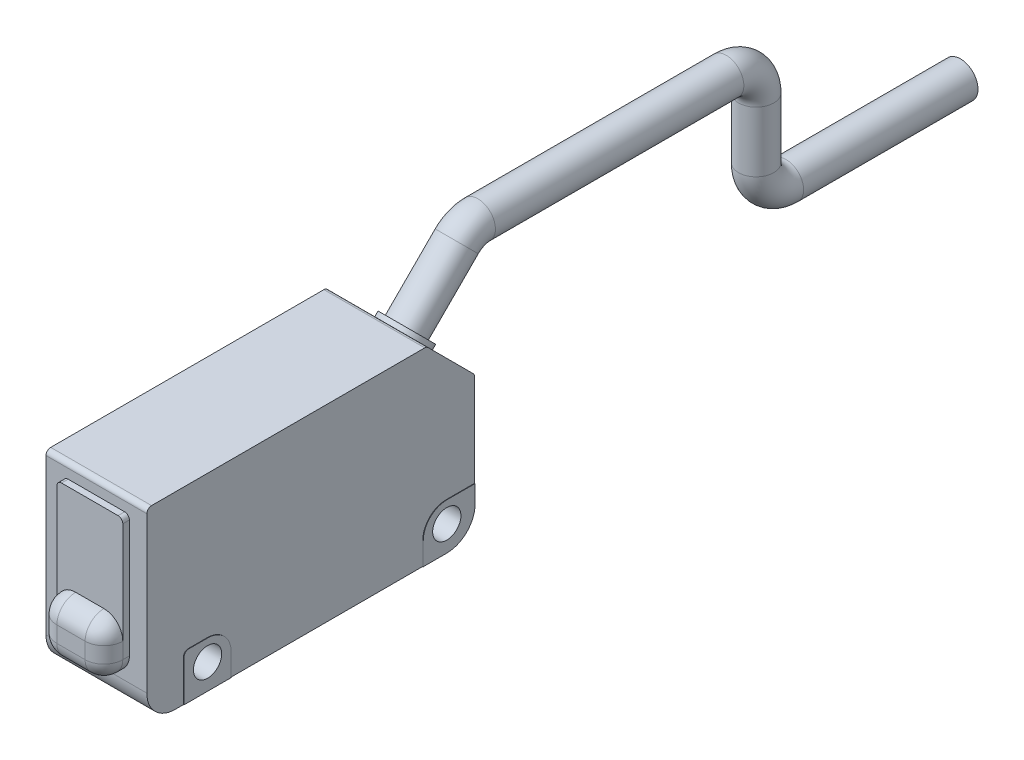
ISO-10303-21;
HEADER;
FILE_DESCRIPTION(('STEP AP214'),'2;1');
FILE_NAME('part.step','',(''),(''),'','','');
FILE_SCHEMA(('AUTOMOTIVE_DESIGN { 1 0 10303 214 1 1 1 1 }'));
ENDSEC;
DATA;
#1=APPLICATION_CONTEXT('core data for automotive mechanical design processes');
#2=APPLICATION_PROTOCOL_DEFINITION('international standard','automotive_design',2000,#1);
#3=PRODUCT_CONTEXT('',#1,'mechanical');
#4=PRODUCT('Part','Part','',(#3));
#5=PRODUCT_RELATED_PRODUCT_CATEGORY('part','',(#4));
#6=PRODUCT_DEFINITION_FORMATION('','',#4);
#7=PRODUCT_DEFINITION_CONTEXT('part definition',#1,'design');
#8=PRODUCT_DEFINITION('design','',#6,#7);
#9=PRODUCT_DEFINITION_SHAPE('','',#8);
#10=(LENGTH_UNIT() NAMED_UNIT(*) SI_UNIT(.MILLI.,.METRE.));
#11=(NAMED_UNIT(*) PLANE_ANGLE_UNIT() SI_UNIT($,.RADIAN.));
#12=(NAMED_UNIT(*) SI_UNIT($,.STERADIAN.) SOLID_ANGLE_UNIT());
#13=UNCERTAINTY_MEASURE_WITH_UNIT(LENGTH_MEASURE(1.E-05),#10,'distance_accuracy_value','');
#14=(GEOMETRIC_REPRESENTATION_CONTEXT(3) GLOBAL_UNCERTAINTY_ASSIGNED_CONTEXT((#13)) GLOBAL_UNIT_ASSIGNED_CONTEXT((#10,
#11,#12)) REPRESENTATION_CONTEXT('',''));
#15=CARTESIAN_POINT('',(0.,0.,0.));
#16=DIRECTION('',(0.,0.,1.));
#17=DIRECTION('',(1.,0.,0.));
#18=AXIS2_PLACEMENT_3D('',#15,#16,#17);
#19=CARTESIAN_POINT('',(0.,28.1353805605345,-14.5454565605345));
#20=DIRECTION('',(0.,-0.707106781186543,0.707106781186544));
#21=DIRECTION('',(0.,-0.707106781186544,-0.707106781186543));
#22=AXIS2_PLACEMENT_3D('',#19,#20,#21);
#23=CYLINDRICAL_SURFACE('',#22,1.8669);
#24=CARTESIAN_POINT('',(0.,14.7552516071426,-1.16532760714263));
#25=DIRECTION('',(0.,-0.707106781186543,0.707106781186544));
#26=DIRECTION('',(0.,-0.707106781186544,-0.707106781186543));
#27=AXIS2_PLACEMENT_3D('',#24,#25,#26);
#28=CIRCLE('',#27,1.8669);
#29=CARTESIAN_POINT('',(0.,13.4351539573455,-2.48542525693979));
#30=VERTEX_POINT('',#29);
#31=EDGE_CURVE('E12',#30,#30,#28,.F.);
#32=ORIENTED_EDGE('',*,*,#31,.T.);
#33=EDGE_LOOP('',(#32));
#34=FACE_BOUND('',#33,.T.);
#35=CARTESIAN_POINT('',(0.,20.0465798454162,-6.45665584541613));
#36=DIRECTION('',(0.,0.70710678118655,-0.707106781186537));
#37=DIRECTION('',(0.,0.707106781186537,0.70710678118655));
#38=AXIS2_PLACEMENT_3D('',#35,#36,#37);
#39=CIRCLE('',#38,1.8669);
#40=CARTESIAN_POINT('',(0.,21.3666774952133,-5.136558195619));
#41=VERTEX_POINT('',#40);
#42=EDGE_CURVE('E1337',#41,#41,#39,.T.);
#43=ORIENTED_EDGE('',*,*,#42,.F.);
#44=EDGE_LOOP('',(#43));
#45=FACE_BOUND('',#44,.T.);
#46=ADVANCED_FACE('F56',(#34,#45),#23,.T.);
#47=CARTESIAN_POINT('',(0.,14.7552516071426,-1.16532760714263));
#48=DIRECTION('',(0.,-0.707106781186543,0.707106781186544));
#49=DIRECTION('',(0.,-0.707106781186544,-0.707106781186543));
#50=AXIS2_PLACEMENT_3D('',#47,#48,#49);
#51=PLANE('',#50);
#52=CARTESIAN_POINT('',(0.,14.7552525,-1.16532849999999));
#53=DIRECTION('',(0.,-0.707106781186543,0.707106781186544));
#54=DIRECTION('',(0.,-0.707106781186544,-0.707106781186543));
#55=AXIS2_PLACEMENT_3D('',#52,#53,#54);
#56=CIRCLE('',#55,2.4999993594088);
#57=CARTESIAN_POINT('',(0.,12.9874851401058,-2.93309585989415));
#58=VERTEX_POINT('',#57);
#59=EDGE_CURVE('E401',#58,#58,#56,.T.);
#60=ORIENTED_EDGE('',*,*,#59,.F.);
#61=EDGE_LOOP('',(#60));
#62=FACE_BOUND('',#61,.T.);
#63=ORIENTED_EDGE('',*,*,#31,.F.);
#64=EDGE_LOOP('',(#63));
#65=FACE_BOUND('',#64,.T.);
#66=ADVANCED_FACE('F548',(#62,#65),#51,.F.);
#67=CARTESIAN_POINT('',(5.35398649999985,17.1530274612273,1.93955346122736));
#68=DIRECTION('',(0.,-0.70710678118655,0.707106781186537));
#69=DIRECTION('',(0.,-0.707106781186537,-0.70710678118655));
#70=AXIS2_PLACEMENT_3D('',#67,#68,#69);
#71=PLANE('',#70);
#72=DIRECTION('',(0.,0.707106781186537,0.70710678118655));
#73=VECTOR('',#72,1.);
#74=CARTESIAN_POINT('',(-5.35398650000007,17.1530274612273,1.93955346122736));
#75=LINE('',#74,#73);
#76=CARTESIAN_POINT('',(-5.35398650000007,12.3599205,-2.85355350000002));
#77=VERTEX_POINT('',#76);
#78=CARTESIAN_POINT('',(-5.35398650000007,17.1530274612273,1.93955346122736));
#79=VERTEX_POINT('',#78);
#80=EDGE_CURVE('E775',#77,#79,#75,.T.);
#81=ORIENTED_EDGE('',*,*,#80,.T.);
#82=DIRECTION('',(-1.,0.,0.));
#83=VECTOR('',#82,1.);
#84=CARTESIAN_POINT('',(5.35398649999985,17.1530274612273,1.93955346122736));
#85=LINE('',#84,#83);
#86=CARTESIAN_POINT('',(5.35398649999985,17.1530274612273,1.93955346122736));
#87=VERTEX_POINT('',#86);
#88=EDGE_CURVE('E770',#87,#79,#85,.T.);
#89=ORIENTED_EDGE('',*,*,#88,.F.);
#90=DIRECTION('',(0.,0.707106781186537,0.70710678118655));
#91=VECTOR('',#90,1.);
#92=CARTESIAN_POINT('',(5.35398649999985,17.1530274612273,1.93955346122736));
#93=LINE('',#92,#91);
#94=CARTESIAN_POINT('',(5.35398649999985,12.3599205,-2.85355350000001));
#95=VERTEX_POINT('',#94);
#96=EDGE_CURVE('E816',#95,#87,#93,.T.);
#97=ORIENTED_EDGE('',*,*,#96,.F.);
#98=DIRECTION('',(-1.,0.,0.));
#99=VECTOR('',#98,1.);
#100=CARTESIAN_POINT('',(5.35398649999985,12.3599205,-2.85355350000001));
#101=LINE('',#100,#99);
#102=EDGE_CURVE('E828',#95,#77,#101,.T.);
#103=ORIENTED_EDGE('',*,*,#102,.T.);
#104=EDGE_LOOP('',(#81,#89,#97,#103));
#105=FACE_BOUND('',#104,.T.);
#106=CARTESIAN_POINT('',(0.,14.401699,-0.811775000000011));
#107=DIRECTION('',(0.,-0.70710678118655,0.707106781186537));
#108=DIRECTION('',(0.,-0.707106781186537,-0.70710678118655));
#109=AXIS2_PLACEMENT_3D('',#106,#107,#108);
#110=CIRCLE('',#109,2.50000057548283);
#111=CARTESIAN_POINT('',(0.,12.6339316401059,-2.57954235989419));
#112=VERTEX_POINT('',#111);
#113=EDGE_CURVE('E65',#112,#112,#110,.F.);
#114=ORIENTED_EDGE('',*,*,#113,.F.);
#115=EDGE_LOOP('',(#114));
#116=FACE_BOUND('',#115,.T.);
#117=ADVANCED_FACE('F546',(#105,#116),#71,.F.);
#118=CARTESIAN_POINT('',(5.35398650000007,-2.69999999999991,0.));
#119=DIRECTION('',(0.,0.999999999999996,0.));
#120=DIRECTION('',(0.,0.,0.999999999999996));
#121=AXIS2_PLACEMENT_3D('',#118,#119,#120);
#122=PLANE('',#121);
#123=DIRECTION('',(-1.,0.,0.));
#124=VECTOR('',#123,1.);
#125=CARTESIAN_POINT('',(5.35398650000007,-2.69999999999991,0.));
#126=LINE('',#125,#124);
#127=CARTESIAN_POINT('',(5.40417650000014,-2.69999999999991,0.));
#128=VERTEX_POINT('',#127);
#129=CARTESIAN_POINT('',(-5.40417649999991,-2.69999999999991,0.));
#130=VERTEX_POINT('',#129);
#131=EDGE_CURVE('E839',#128,#130,#126,.T.);
#132=ORIENTED_EDGE('',*,*,#131,.F.);
#133=DIRECTION('',(0.,0.,-0.999999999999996));
#134=VECTOR('',#133,1.);
#135=CARTESIAN_POINT('',(5.40417650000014,-2.69999999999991,0.));
#136=LINE('',#135,#134);
#137=CARTESIAN_POINT('',(5.40417650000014,-2.6999999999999,2.5));
#138=VERTEX_POINT('',#137);
#139=EDGE_CURVE('E965',#138,#128,#136,.T.);
#140=ORIENTED_EDGE('',*,*,#139,.F.);
#141=DIRECTION('',(-1.,0.,0.));
#142=VECTOR('',#141,1.);
#143=CARTESIAN_POINT('',(5.40417650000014,-2.6999999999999,2.5));
#144=LINE('',#143,#142);
#145=CARTESIAN_POINT('',(5.35398650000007,-2.6999999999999,2.5));
#146=VERTEX_POINT('',#145);
#147=EDGE_CURVE('E992',#138,#146,#144,.T.);
#148=ORIENTED_EDGE('',*,*,#147,.T.);
#149=DIRECTION('',(0.,0.,-0.999999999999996));
#150=VECTOR('',#149,1.);
#151=CARTESIAN_POINT('',(5.35398650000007,-2.69999999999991,0.));
#152=LINE('',#151,#150);
#153=CARTESIAN_POINT('',(5.35398650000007,-2.69999999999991,22.8999999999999));
#154=VERTEX_POINT('',#153);
#155=EDGE_CURVE('E806',#154,#146,#152,.T.);
#156=ORIENTED_EDGE('',*,*,#155,.F.);
#157=DIRECTION('',(-1.,0.,0.));
#158=VECTOR('',#157,1.);
#159=CARTESIAN_POINT('',(5.40417650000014,-2.69999999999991,22.8999999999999));
#160=LINE('',#159,#158);
#161=CARTESIAN_POINT('',(5.40417650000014,-2.69999999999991,22.8999999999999));
#162=VERTEX_POINT('',#161);
#163=EDGE_CURVE('E1065',#162,#154,#160,.T.);
#164=ORIENTED_EDGE('',*,*,#163,.F.);
#165=DIRECTION('',(0.,0.,-0.999999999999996));
#166=VECTOR('',#165,1.);
#167=CARTESIAN_POINT('',(5.40417650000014,-2.69999999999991,22.8999999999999));
#168=LINE('',#167,#166);
#169=CARTESIAN_POINT('',(5.40417650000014,-2.69999999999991,27.8999999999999));
#170=VERTEX_POINT('',#169);
#171=EDGE_CURVE('E1058',#170,#162,#168,.T.);
#172=ORIENTED_EDGE('',*,*,#171,.F.);
#173=DIRECTION('',(-1.,0.,0.));
#174=VECTOR('',#173,1.);
#175=CARTESIAN_POINT('',(5.40417650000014,-2.69999999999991,27.8999999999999));
#176=LINE('',#175,#174);
#177=CARTESIAN_POINT('',(5.35398650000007,-2.69999999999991,27.8999999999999));
#178=VERTEX_POINT('',#177);
#179=EDGE_CURVE('E1070',#170,#178,#176,.T.);
#180=ORIENTED_EDGE('',*,*,#179,.T.);
#181=CARTESIAN_POINT('',(5.35398650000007,-2.69999999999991,28.7999999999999));
#182=VERTEX_POINT('',#181);
#183=EDGE_CURVE('E807',#182,#178,#152,.T.);
#184=ORIENTED_EDGE('',*,*,#183,.F.);
#185=DIRECTION('',(-1.,0.,0.));
#186=VECTOR('',#185,1.);
#187=CARTESIAN_POINT('',(5.35398650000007,-2.69999999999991,28.7999999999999));
#188=LINE('',#187,#186);
#189=CARTESIAN_POINT('',(-5.35398649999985,-2.69999999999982,28.7999999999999));
#190=VERTEX_POINT('',#189);
#191=EDGE_CURVE('E842',#182,#190,#188,.T.);
#192=ORIENTED_EDGE('',*,*,#191,.T.);
#193=DIRECTION('',(0.,0.,-0.999999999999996));
#194=VECTOR('',#193,1.);
#195=CARTESIAN_POINT('',(-5.35398649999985,-2.69999999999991,0.));
#196=LINE('',#195,#194);
#197=CARTESIAN_POINT('',(-5.35398649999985,-2.69999999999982,27.8999999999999));
#198=VERTEX_POINT('',#197);
#199=EDGE_CURVE('E1115',#190,#198,#196,.T.);
#200=ORIENTED_EDGE('',*,*,#199,.T.);
#201=CARTESIAN_POINT('',(-5.40417649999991,-2.69999999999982,27.8999999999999));
#202=VERTEX_POINT('',#201);
#203=EDGE_CURVE('E1069',#198,#202,#176,.T.);
#204=ORIENTED_EDGE('',*,*,#203,.T.);
#205=DIRECTION('',(0.,0.,-0.999999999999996));
#206=VECTOR('',#205,1.);
#207=CARTESIAN_POINT('',(-5.40417649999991,-2.6999999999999,22.8999999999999));
#208=LINE('',#207,#206);
#209=CARTESIAN_POINT('',(-5.40417649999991,-2.6999999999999,22.8999999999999));
#210=VERTEX_POINT('',#209);
#211=EDGE_CURVE('E1038',#202,#210,#208,.T.);
#212=ORIENTED_EDGE('',*,*,#211,.T.);
#213=CARTESIAN_POINT('',(-5.35398649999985,-2.6999999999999,22.8999999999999));
#214=VERTEX_POINT('',#213);
#215=EDGE_CURVE('E1061',#214,#210,#160,.T.);
#216=ORIENTED_EDGE('',*,*,#215,.F.);
#217=CARTESIAN_POINT('',(-5.35398649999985,-2.69999999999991,2.5));
#218=VERTEX_POINT('',#217);
#219=EDGE_CURVE('E1114',#214,#218,#196,.T.);
#220=ORIENTED_EDGE('',*,*,#219,.T.);
#221=CARTESIAN_POINT('',(-5.40417649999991,-2.69999999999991,2.5));
#222=VERTEX_POINT('',#221);
#223=EDGE_CURVE('E991',#218,#222,#144,.T.);
#224=ORIENTED_EDGE('',*,*,#223,.T.);
#225=DIRECTION('',(0.,0.,-0.999999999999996));
#226=VECTOR('',#225,1.);
#227=CARTESIAN_POINT('',(-5.40417649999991,-2.69999999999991,0.));
#228=LINE('',#227,#226);
#229=EDGE_CURVE('E942',#222,#130,#228,.T.);
#230=ORIENTED_EDGE('',*,*,#229,.T.);
#231=EDGE_LOOP('',(#132,#140,#148,#156,#164,#172,#180,#184,#192,#200,#204,#212,#216,#220,#224,#230));
#232=FACE_BOUND('',#231,.T.);
#233=CARTESIAN_POINT('',(-3.19582350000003,-2.69999999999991,3.79875));
#234=DIRECTION('',(0.,0.999999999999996,0.));
#235=DIRECTION('',(1.,0.,0.));
#236=AXIS2_PLACEMENT_3D('',#233,#234,#235);
#237=CIRCLE('',#236,0.3);
#238=CARTESIAN_POINT('',(-3.19582350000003,-2.69999999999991,3.49875));
#239=VERTEX_POINT('',#238);
#240=CARTESIAN_POINT('',(-3.49582349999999,-2.69999999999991,3.79875));
#241=VERTEX_POINT('',#240);
#242=EDGE_CURVE('E72',#239,#241,#237,.T.);
#243=ORIENTED_EDGE('',*,*,#242,.T.);
#244=DIRECTION('',(0.,0.,0.999999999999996));
#245=VECTOR('',#244,1.);
#246=CARTESIAN_POINT('',(-3.49582349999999,-2.69999999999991,3.79875));
#247=LINE('',#246,#245);
#248=CARTESIAN_POINT('',(-3.49582349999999,-2.6999999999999,21.5987499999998));
#249=VERTEX_POINT('',#248);
#250=EDGE_CURVE('E377',#241,#249,#247,.T.);
#251=ORIENTED_EDGE('',*,*,#250,.T.);
#252=CARTESIAN_POINT('',(-3.19582350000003,-2.6999999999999,21.5987499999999));
#253=DIRECTION('',(0.,0.999999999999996,0.));
#254=DIRECTION('',(1.,0.,0.));
#255=AXIS2_PLACEMENT_3D('',#252,#253,#254);
#256=CIRCLE('',#255,0.3);
#257=CARTESIAN_POINT('',(-3.19582350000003,-2.6999999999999,21.8987499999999));
#258=VERTEX_POINT('',#257);
#259=EDGE_CURVE('E386',#249,#258,#256,.T.);
#260=ORIENTED_EDGE('',*,*,#259,.T.);
#261=DIRECTION('',(1.,0.,0.));
#262=VECTOR('',#261,1.);
#263=CARTESIAN_POINT('',(-3.19582350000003,-2.6999999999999,21.8987499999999));
#264=LINE('',#263,#262);
#265=CARTESIAN_POINT('',(3.20417650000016,-2.69999999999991,21.8987499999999));
#266=VERTEX_POINT('',#265);
#267=EDGE_CURVE('E1296',#258,#266,#264,.T.);
#268=ORIENTED_EDGE('',*,*,#267,.T.);
#269=CARTESIAN_POINT('',(3.20417650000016,-2.69999999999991,21.5987499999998));
#270=DIRECTION('',(0.,0.999999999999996,0.));
#271=DIRECTION('',(-1.,0.,0.));
#272=AXIS2_PLACEMENT_3D('',#269,#270,#271);
#273=CIRCLE('',#272,0.3);
#274=CARTESIAN_POINT('',(3.50417650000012,-2.69999999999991,21.5987499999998));
#275=VERTEX_POINT('',#274);
#276=EDGE_CURVE('E1289',#266,#275,#273,.T.);
#277=ORIENTED_EDGE('',*,*,#276,.T.);
#278=DIRECTION('',(0.,0.,-0.999999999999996));
#279=VECTOR('',#278,1.);
#280=CARTESIAN_POINT('',(3.50417650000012,-2.69999999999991,21.5987499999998));
#281=LINE('',#280,#279);
#282=CARTESIAN_POINT('',(3.50417650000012,-2.69999999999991,3.79875));
#283=VERTEX_POINT('',#282);
#284=EDGE_CURVE('E1283',#275,#283,#281,.T.);
#285=ORIENTED_EDGE('',*,*,#284,.T.);
#286=CARTESIAN_POINT('',(3.20417650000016,-2.69999999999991,3.79874999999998));
#287=DIRECTION('',(0.,0.999999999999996,0.));
#288=DIRECTION('',(-1.,0.,0.));
#289=AXIS2_PLACEMENT_3D('',#286,#287,#288);
#290=CIRCLE('',#289,0.3);
#291=CARTESIAN_POINT('',(3.20417650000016,-2.69999999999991,3.49874999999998));
#292=VERTEX_POINT('',#291);
#293=EDGE_CURVE('E1278',#283,#292,#290,.T.);
#294=ORIENTED_EDGE('',*,*,#293,.T.);
#295=DIRECTION('',(-1.,0.,0.));
#296=VECTOR('',#295,1.);
#297=CARTESIAN_POINT('',(3.20417650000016,-2.69999999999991,3.49874999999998));
#298=LINE('',#297,#296);
#299=EDGE_CURVE('E399',#292,#239,#298,.T.);
#300=ORIENTED_EDGE('',*,*,#299,.T.);
#301=EDGE_LOOP('',(#243,#251,#260,#268,#277,#285,#294,#300));
#302=FACE_BOUND('',#301,.T.);
#303=ADVANCED_FACE('F396',(#232,#302),#122,.F.);
#304=CARTESIAN_POINT('',(3.00000000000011,15.3,32.4999999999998));
#305=DIRECTION('',(0.,0.,-0.999999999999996));
#306=DIRECTION('',(-1.,0.,0.));
#307=AXIS2_PLACEMENT_3D('',#304,#305,#306);
#308=PLANE('',#307);
#309=CARTESIAN_POINT('',(1.50000000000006,4.5,32.4999999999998));
#310=DIRECTION('',(0.,0.,0.999999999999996));
#311=DIRECTION('',(0.,-0.999999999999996,0.));
#312=AXIS2_PLACEMENT_3D('',#309,#310,#311);
#313=CIRCLE('',#312,2.);
#314=CARTESIAN_POINT('',(3.50000000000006,4.5,32.4999999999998));
#315=VERTEX_POINT('',#314);
#316=CARTESIAN_POINT('',(1.50000000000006,6.50000000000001,32.4999999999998));
#317=VERTEX_POINT('',#316);
#318=EDGE_CURVE('E484',#315,#317,#313,.T.);
#319=ORIENTED_EDGE('',*,*,#318,.F.);
#320=DIRECTION('',(0.,-0.999999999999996,0.));
#321=VECTOR('',#320,1.);
#322=CARTESIAN_POINT('',(3.50000000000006,15.3,32.4999999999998));
#323=LINE('',#322,#321);
#324=CARTESIAN_POINT('',(3.50000000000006,15.3,32.4999999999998));
#325=VERTEX_POINT('',#324);
#326=EDGE_CURVE('E878',#325,#315,#323,.T.);
#327=ORIENTED_EDGE('',*,*,#326,.F.);
#328=CARTESIAN_POINT('',(3.00000000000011,15.3,32.4999999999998));
#329=DIRECTION('',(0.,0.,-0.999999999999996));
#330=DIRECTION('',(0.,-0.999999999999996,0.));
#331=AXIS2_PLACEMENT_3D('',#328,#329,#330);
#332=CIRCLE('',#331,0.5);
#333=CARTESIAN_POINT('',(3.00000000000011,15.8,32.4999999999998));
#334=VERTEX_POINT('',#333);
#335=EDGE_CURVE('E892',#334,#325,#332,.T.);
#336=ORIENTED_EDGE('',*,*,#335,.F.);
#337=DIRECTION('',(1.,0.,0.));
#338=VECTOR('',#337,1.);
#339=CARTESIAN_POINT('',(3.00000000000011,15.8,32.4999999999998));
#340=LINE('',#339,#338);
#341=CARTESIAN_POINT('',(-2.99999999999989,15.8,32.4999999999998));
#342=VERTEX_POINT('',#341);
#343=EDGE_CURVE('E887',#342,#334,#340,.T.);
#344=ORIENTED_EDGE('',*,*,#343,.F.);
#345=CARTESIAN_POINT('',(-2.99999999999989,15.3,32.4999999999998));
#346=DIRECTION('',(0.,0.,-0.999999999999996));
#347=DIRECTION('',(0.,-0.999999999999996,0.));
#348=AXIS2_PLACEMENT_3D('',#345,#346,#347);
#349=CIRCLE('',#348,0.5);
#350=CARTESIAN_POINT('',(-3.49999999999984,15.3,32.4999999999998));
#351=VERTEX_POINT('',#350);
#352=EDGE_CURVE('E877',#351,#342,#349,.T.);
#353=ORIENTED_EDGE('',*,*,#352,.F.);
#354=DIRECTION('',(0.,0.999999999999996,0.));
#355=VECTOR('',#354,1.);
#356=CARTESIAN_POINT('',(-3.49999999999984,15.3,32.4999999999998));
#357=LINE('',#356,#355);
#358=CARTESIAN_POINT('',(-3.49999999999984,4.5,32.4999999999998));
#359=VERTEX_POINT('',#358);
#360=EDGE_CURVE('E873',#359,#351,#357,.T.);
#361=ORIENTED_EDGE('',*,*,#360,.F.);
#362=CARTESIAN_POINT('',(-1.49999999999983,4.5,32.4999999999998));
#363=DIRECTION('',(0.,0.,0.999999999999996));
#364=DIRECTION('',(0.,0.999999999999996,0.));
#365=AXIS2_PLACEMENT_3D('',#362,#363,#364);
#366=CIRCLE('',#365,2.);
#367=CARTESIAN_POINT('',(-1.49999999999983,6.50000000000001,32.4999999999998));
#368=VERTEX_POINT('',#367);
#369=EDGE_CURVE('E483',#368,#359,#366,.T.);
#370=ORIENTED_EDGE('',*,*,#369,.F.);
#371=DIRECTION('',(-1.,0.,0.));
#372=VECTOR('',#371,1.);
#373=CARTESIAN_POINT('',(1.50000000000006,6.50000000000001,32.4999999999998));
#374=LINE('',#373,#372);
#375=EDGE_CURVE('E479',#317,#368,#374,.T.);
#376=ORIENTED_EDGE('',*,*,#375,.F.);
#377=EDGE_LOOP('',(#319,#327,#336,#344,#353,#361,#370,#376));
#378=FACE_BOUND('',#377,.T.);
#379=ADVANCED_FACE('F555',(#378),#308,.F.);
#380=CARTESIAN_POINT('',(5.40417649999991,-0.299999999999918,0.));
#381=DIRECTION('',(1.,0.,0.));
#382=DIRECTION('',(0.,0.999999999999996,0.));
#383=AXIS2_PLACEMENT_3D('',#380,#381,#382);
#384=PLANE('',#383);
#385=CARTESIAN_POINT('',(5.40417649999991,-0.299999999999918,0.));
#386=DIRECTION('',(1.,0.,0.));
#387=DIRECTION('',(0.,0.999999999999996,0.));
#388=AXIS2_PLACEMENT_3D('',#385,#386,#387);
#389=CIRCLE('',#388,2.5);
#390=CARTESIAN_POINT('',(5.40417649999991,2.20000000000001,0.));
#391=VERTEX_POINT('',#390);
#392=CARTESIAN_POINT('',(5.40417650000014,-0.299999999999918,2.49999999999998));
#393=VERTEX_POINT('',#392);
#394=EDGE_CURVE('E958',#391,#393,#389,.T.);
#395=ORIENTED_EDGE('',*,*,#394,.T.);
#396=DIRECTION('',(0.,-0.999999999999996,0.));
#397=VECTOR('',#396,1.);
#398=CARTESIAN_POINT('',(5.40417650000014,-0.299999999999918,2.49999999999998));
#399=LINE('',#398,#397);
#400=EDGE_CURVE('E962',#393,#138,#399,.T.);
#401=ORIENTED_EDGE('',*,*,#400,.T.);
#402=ORIENTED_EDGE('',*,*,#139,.T.);
#403=CARTESIAN_POINT('',(5.40417649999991,0.299999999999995,0.));
#404=DIRECTION('',(1.,0.,0.));
#405=DIRECTION('',(0.,0.999999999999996,0.));
#406=AXIS2_PLACEMENT_3D('',#403,#404,#405);
#407=CIRCLE('',#406,3.);
#408=CARTESIAN_POINT('',(5.40417649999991,0.299999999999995,-2.99999999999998));
#409=VERTEX_POINT('',#408);
#410=EDGE_CURVE('E969',#128,#409,#407,.T.);
#411=ORIENTED_EDGE('',*,*,#410,.T.);
#412=DIRECTION('',(0.,0.999999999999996,0.));
#413=VECTOR('',#412,1.);
#414=CARTESIAN_POINT('',(5.40417649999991,0.299999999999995,-2.99999999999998));
#415=LINE('',#414,#413);
#416=CARTESIAN_POINT('',(5.40417649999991,2.20000000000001,-2.99999999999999));
#417=VERTEX_POINT('',#416);
#418=EDGE_CURVE('E973',#409,#417,#415,.T.);
#419=ORIENTED_EDGE('',*,*,#418,.T.);
#420=DIRECTION('',(0.,0.,0.999999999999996));
#421=VECTOR('',#420,1.);
#422=CARTESIAN_POINT('',(5.40417649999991,2.20000000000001,-2.99999999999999));
#423=LINE('',#422,#421);
#424=EDGE_CURVE('E976',#417,#391,#423,.T.);
#425=ORIENTED_EDGE('',*,*,#424,.T.);
#426=EDGE_LOOP('',(#395,#401,#402,#411,#419,#425));
#427=FACE_BOUND('',#426,.T.);
#428=CARTESIAN_POINT('',(5.40417649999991,0.,0.));
#429=DIRECTION('',(1.,0.,0.));
#430=DIRECTION('',(0.,0.999999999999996,0.));
#431=AXIS2_PLACEMENT_3D('',#428,#429,#430);
#432=CIRCLE('',#431,1.5);
#433=CARTESIAN_POINT('',(5.40417649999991,1.49999999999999,0.));
#434=VERTEX_POINT('',#433);
#435=EDGE_CURVE('E925',#434,#434,#432,.F.);
#436=ORIENTED_EDGE('',*,*,#435,.T.);
#437=EDGE_LOOP('',(#436));
#438=FACE_BOUND('',#437,.T.);
#439=ADVANCED_FACE('F646',(#427,#438),#384,.T.);
#440=CARTESIAN_POINT('',(5.40417650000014,-0.299999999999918,25.3999999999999));
#441=DIRECTION('',(1.,0.,0.));
#442=DIRECTION('',(0.,0.999999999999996,0.));
#443=AXIS2_PLACEMENT_3D('',#440,#441,#442);
#444=PLANE('',#443);
#445=DIRECTION('',(0.,0.999999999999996,0.));
#446=VECTOR('',#445,1.);
#447=CARTESIAN_POINT('',(5.40417650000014,-0.299999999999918,22.8999999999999));
#448=LINE('',#447,#446);
#449=CARTESIAN_POINT('',(5.40417650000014,-0.299999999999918,22.8999999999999));
#450=VERTEX_POINT('',#449);
#451=EDGE_CURVE('E1042',#162,#450,#448,.T.);
#452=ORIENTED_EDGE('',*,*,#451,.T.);
#453=CARTESIAN_POINT('',(5.40417650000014,-0.299999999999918,25.3999999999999));
#454=DIRECTION('',(1.,0.,0.));
#455=DIRECTION('',(0.,-0.999999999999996,0.));
#456=AXIS2_PLACEMENT_3D('',#453,#454,#455);
#457=CIRCLE('',#456,2.5);
#458=CARTESIAN_POINT('',(5.40417650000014,2.19969278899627,25.4391913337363));
#459=VERTEX_POINT('',#458);
#460=EDGE_CURVE('E1046',#450,#459,#457,.T.);
#461=ORIENTED_EDGE('',*,*,#460,.T.);
#462=DIRECTION('',(0.,-4.02383095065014E-07,0.999999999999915));
#463=VECTOR('',#462,1.);
#464=CARTESIAN_POINT('',(5.40417650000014,2.19969199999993,27.4000002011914));
#465=LINE('',#464,#463);
#466=CARTESIAN_POINT('',(5.40417650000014,2.19969199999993,27.4000002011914));
#467=VERTEX_POINT('',#466);
#468=EDGE_CURVE('E1049',#459,#467,#465,.T.);
#469=ORIENTED_EDGE('',*,*,#468,.T.);
#470=CARTESIAN_POINT('',(5.40417650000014,1.699692,27.3999999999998));
#471=DIRECTION('',(1.,0.,0.));
#472=DIRECTION('',(0.,0.999999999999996,0.));
#473=AXIS2_PLACEMENT_3D('',#470,#471,#472);
#474=CIRCLE('',#473,0.5);
#475=CARTESIAN_POINT('',(5.40417650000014,1.699692,27.8999999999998));
#476=VERTEX_POINT('',#475);
#477=EDGE_CURVE('E1052',#467,#476,#474,.T.);
#478=ORIENTED_EDGE('',*,*,#477,.T.);
#479=DIRECTION('',(0.,-0.999999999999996,0.));
#480=VECTOR('',#479,1.);
#481=CARTESIAN_POINT('',(5.40417650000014,-2.69999999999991,27.8999999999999));
#482=LINE('',#481,#480);
#483=EDGE_CURVE('E1055',#476,#170,#482,.T.);
#484=ORIENTED_EDGE('',*,*,#483,.T.);
#485=ORIENTED_EDGE('',*,*,#171,.T.);
#486=EDGE_LOOP('',(#452,#461,#469,#478,#484,#485));
#487=FACE_BOUND('',#486,.T.);
#488=CARTESIAN_POINT('',(5.40417650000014,0.,25.4));
#489=DIRECTION('',(1.,0.,0.));
#490=DIRECTION('',(0.,0.999999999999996,0.));
#491=AXIS2_PLACEMENT_3D('',#488,#489,#490);
#492=CIRCLE('',#491,1.5);
#493=CARTESIAN_POINT('',(5.40417650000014,1.49999999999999,25.4));
#494=VERTEX_POINT('',#493);
#495=EDGE_CURVE('E933',#494,#494,#492,.F.);
#496=ORIENTED_EDGE('',*,*,#495,.T.);
#497=EDGE_LOOP('',(#496));
#498=FACE_BOUND('',#497,.T.);
#499=ADVANCED_FACE('F695',(#487,#498),#444,.T.);
#500=CARTESIAN_POINT('',(5.35398650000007,16.8,31.2999999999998));
#501=DIRECTION('',(1.,0.,0.));
#502=DIRECTION('',(0.,0.999999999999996,0.));
#503=AXIS2_PLACEMENT_3D('',#500,#501,#502);
#504=PLANE('',#503);
#505=ORIENTED_EDGE('',*,*,#155,.T.);
#506=DIRECTION('',(0.,0.999999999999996,0.));
#507=VECTOR('',#506,1.);
#508=CARTESIAN_POINT('',(5.35398649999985,16.8,2.5));
#509=LINE('',#508,#507);
#510=CARTESIAN_POINT('',(5.35398650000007,-0.299999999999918,2.49999999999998));
#511=VERTEX_POINT('',#510);
#512=EDGE_CURVE('E1013',#146,#511,#509,.T.);
#513=ORIENTED_EDGE('',*,*,#512,.T.);
#514=CARTESIAN_POINT('',(5.35398649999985,-0.299999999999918,0.));
#515=DIRECTION('',(1.,0.,0.));
#516=DIRECTION('',(0.,0.999999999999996,0.));
#517=AXIS2_PLACEMENT_3D('',#514,#515,#516);
#518=CIRCLE('',#517,2.5);
#519=CARTESIAN_POINT('',(5.35398649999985,2.20000000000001,0.));
#520=VERTEX_POINT('',#519);
#521=EDGE_CURVE('E1017',#511,#520,#518,.F.);
#522=ORIENTED_EDGE('',*,*,#521,.T.);
#523=DIRECTION('',(0.,0.,-0.999999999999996));
#524=VECTOR('',#523,1.);
#525=CARTESIAN_POINT('',(5.35398650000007,2.19999999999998,31.2999999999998));
#526=LINE('',#525,#524);
#527=CARTESIAN_POINT('',(5.35398649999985,2.20000000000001,-2.99999999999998));
#528=VERTEX_POINT('',#527);
#529=EDGE_CURVE('E1005',#520,#528,#526,.T.);
#530=ORIENTED_EDGE('',*,*,#529,.T.);
#531=DIRECTION('',(0.,0.999999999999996,0.));
#532=VECTOR('',#531,1.);
#533=CARTESIAN_POINT('',(5.35398649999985,0.299999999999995,-2.99999999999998));
#534=LINE('',#533,#532);
#535=CARTESIAN_POINT('',(5.35398649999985,12.0060363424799,-2.99999999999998));
#536=VERTEX_POINT('',#535);
#537=EDGE_CURVE('E810',#528,#536,#534,.T.);
#538=ORIENTED_EDGE('',*,*,#537,.T.);
#539=CARTESIAN_POINT('',(5.35398649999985,12.0063671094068,-2.50000010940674));
#540=DIRECTION('',(1.,0.,0.));
#541=DIRECTION('',(0.,0.999999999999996,0.));
#542=AXIS2_PLACEMENT_3D('',#539,#540,#541);
#543=CIRCLE('',#542,0.5);
#544=EDGE_CURVE('E813',#536,#95,#543,.T.);
#545=ORIENTED_EDGE('',*,*,#544,.T.);
#546=ORIENTED_EDGE('',*,*,#96,.T.);
#547=CARTESIAN_POINT('',(5.35398649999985,16.8,2.293632));
#548=DIRECTION('',(1.,0.,0.));
#549=DIRECTION('',(0.,-0.999999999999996,0.));
#550=AXIS2_PLACEMENT_3D('',#547,#548,#549);
#551=CIRCLE('',#550,0.5);
#552=CARTESIAN_POINT('',(5.35398649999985,17.3,2.293632));
#553=VERTEX_POINT('',#552);
#554=EDGE_CURVE('E819',#87,#553,#551,.T.);
#555=ORIENTED_EDGE('',*,*,#554,.T.);
#556=DIRECTION('',(0.,0.,0.999999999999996));
#557=VECTOR('',#556,1.);
#558=CARTESIAN_POINT('',(5.35398650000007,17.3,31.2999999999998));
#559=LINE('',#558,#557);
#560=CARTESIAN_POINT('',(5.35398650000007,17.3,31.2999999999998));
#561=VERTEX_POINT('',#560);
#562=EDGE_CURVE('E779',#553,#561,#559,.T.);
#563=ORIENTED_EDGE('',*,*,#562,.T.);
#564=CARTESIAN_POINT('',(5.35398650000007,16.8,31.2999999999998));
#565=DIRECTION('',(1.,0.,0.));
#566=DIRECTION('',(0.,0.999999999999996,0.));
#567=AXIS2_PLACEMENT_3D('',#564,#565,#566);
#568=CIRCLE('',#567,0.5);
#569=CARTESIAN_POINT('',(5.35398650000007,16.8,31.7999999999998));
#570=VERTEX_POINT('',#569);
#571=EDGE_CURVE('E787',#561,#570,#568,.T.);
#572=ORIENTED_EDGE('',*,*,#571,.T.);
#573=DIRECTION('',(0.,-0.999999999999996,0.));
#574=VECTOR('',#573,1.);
#575=CARTESIAN_POINT('',(5.35398650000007,16.8,31.7999999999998));
#576=LINE('',#575,#574);
#577=CARTESIAN_POINT('',(5.35398650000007,0.300000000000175,31.7999999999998));
#578=VERTEX_POINT('',#577);
#579=EDGE_CURVE('E793',#570,#578,#576,.T.);
#580=ORIENTED_EDGE('',*,*,#579,.T.);
#581=CARTESIAN_POINT('',(5.35398650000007,0.299999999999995,28.8));
#582=DIRECTION('',(1.,0.,0.));
#583=DIRECTION('',(0.,0.999999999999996,0.));
#584=AXIS2_PLACEMENT_3D('',#581,#582,#583);
#585=CIRCLE('',#584,3.);
#586=EDGE_CURVE('E803',#578,#182,#585,.T.);
#587=ORIENTED_EDGE('',*,*,#586,.T.);
#588=ORIENTED_EDGE('',*,*,#183,.T.);
#589=DIRECTION('',(0.,0.999999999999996,0.));
#590=VECTOR('',#589,1.);
#591=CARTESIAN_POINT('',(5.35398650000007,16.8,27.8999999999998));
#592=LINE('',#591,#590);
#593=CARTESIAN_POINT('',(5.35398650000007,1.699692,27.8999999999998));
#594=VERTEX_POINT('',#593);
#595=EDGE_CURVE('E1094',#178,#594,#592,.T.);
#596=ORIENTED_EDGE('',*,*,#595,.T.);
#597=CARTESIAN_POINT('',(5.35398650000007,1.699692,27.3999999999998));
#598=DIRECTION('',(1.,0.,0.));
#599=DIRECTION('',(0.,0.999999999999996,0.));
#600=AXIS2_PLACEMENT_3D('',#597,#598,#599);
#601=CIRCLE('',#600,0.5);
#602=CARTESIAN_POINT('',(5.35398650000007,2.199692,27.3999999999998));
#603=VERTEX_POINT('',#602);
#604=EDGE_CURVE('E1097',#594,#603,#601,.F.);
#605=ORIENTED_EDGE('',*,*,#604,.T.);
#606=DIRECTION('',(0.,4.02383095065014E-07,-0.999999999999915));
#607=VECTOR('',#606,1.);
#608=CARTESIAN_POINT('',(5.35398650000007,2.19969043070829,31.2999941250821));
#609=LINE('',#608,#607);
#610=CARTESIAN_POINT('',(5.35398650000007,2.19969278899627,25.4391913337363));
#611=VERTEX_POINT('',#610);
#612=EDGE_CURVE('E1100',#603,#611,#609,.T.);
#613=ORIENTED_EDGE('',*,*,#612,.T.);
#614=CARTESIAN_POINT('',(5.35398650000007,-0.299999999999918,25.3999999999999));
#615=DIRECTION('',(1.,0.,0.));
#616=DIRECTION('',(0.,0.999999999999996,0.));
#617=AXIS2_PLACEMENT_3D('',#614,#615,#616);
#618=CIRCLE('',#617,2.5);
#619=CARTESIAN_POINT('',(5.35398650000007,-0.299999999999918,22.8999999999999));
#620=VERTEX_POINT('',#619);
#621=EDGE_CURVE('E1103',#611,#620,#618,.F.);
#622=ORIENTED_EDGE('',*,*,#621,.T.);
#623=DIRECTION('',(0.,-0.999999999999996,0.));
#624=VECTOR('',#623,1.);
#625=CARTESIAN_POINT('',(5.35398650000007,16.8,22.8999999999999));
#626=LINE('',#625,#624);
#627=EDGE_CURVE('E800',#620,#154,#626,.T.);
#628=ORIENTED_EDGE('',*,*,#627,.T.);
#629=EDGE_LOOP('',(#505,#513,#522,#530,#538,#545,#546,#555,#563,#572,#580,#587,#588,#596,#605,
#613,#622,#628));
#630=FACE_BOUND('',#629,.T.);
#631=ADVANCED_FACE('F718',(#630),#504,.T.);
#632=CARTESIAN_POINT('',(-5.35398649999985,16.8,31.2999999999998));
#633=DIRECTION('',(1.,0.,0.));
#634=DIRECTION('',(0.,0.999999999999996,0.));
#635=AXIS2_PLACEMENT_3D('',#632,#633,#634);
#636=PLANE('',#635);
#637=DIRECTION('',(0.,0.999999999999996,0.));
#638=VECTOR('',#637,1.);
#639=CARTESIAN_POINT('',(-5.35398650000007,16.8,2.5));
#640=LINE('',#639,#638);
#641=CARTESIAN_POINT('',(-5.35398649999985,-0.299999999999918,2.49999999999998));
#642=VERTEX_POINT('',#641);
#643=EDGE_CURVE('E1009',#218,#642,#640,.T.);
#644=ORIENTED_EDGE('',*,*,#643,.F.);
#645=ORIENTED_EDGE('',*,*,#219,.F.);
#646=DIRECTION('',(0.,-0.999999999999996,0.));
#647=VECTOR('',#646,1.);
#648=CARTESIAN_POINT('',(-5.35398649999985,16.8,22.9));
#649=LINE('',#648,#647);
#650=CARTESIAN_POINT('',(-5.35398649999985,-0.299999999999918,22.8999999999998));
#651=VERTEX_POINT('',#650);
#652=EDGE_CURVE('E866',#651,#214,#649,.T.);
#653=ORIENTED_EDGE('',*,*,#652,.F.);
#654=CARTESIAN_POINT('',(-5.35398649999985,-0.299999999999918,25.3999999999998));
#655=DIRECTION('',(1.,0.,0.));
#656=DIRECTION('',(0.,0.999999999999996,0.));
#657=AXIS2_PLACEMENT_3D('',#654,#655,#656);
#658=CIRCLE('',#657,2.5);
#659=CARTESIAN_POINT('',(-5.35398649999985,2.19969278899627,25.4391913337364));
#660=VERTEX_POINT('',#659);
#661=EDGE_CURVE('E863',#660,#651,#658,.F.);
#662=ORIENTED_EDGE('',*,*,#661,.F.);
#663=DIRECTION('',(0.,4.02383095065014E-07,-0.999999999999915));
#664=VECTOR('',#663,1.);
#665=CARTESIAN_POINT('',(-5.35398649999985,2.19969043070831,31.2999941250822));
#666=LINE('',#665,#664);
#667=CARTESIAN_POINT('',(-5.35398649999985,2.19969199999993,27.4000002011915));
#668=VERTEX_POINT('',#667);
#669=EDGE_CURVE('E860',#668,#660,#666,.T.);
#670=ORIENTED_EDGE('',*,*,#669,.F.);
#671=CARTESIAN_POINT('',(-5.35398649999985,1.699692,27.3999999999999));
#672=DIRECTION('',(1.,0.,0.));
#673=DIRECTION('',(0.,0.999999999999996,0.));
#674=AXIS2_PLACEMENT_3D('',#671,#672,#673);
#675=CIRCLE('',#674,0.5);
#676=CARTESIAN_POINT('',(-5.35398649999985,1.699692,27.8999999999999));
#677=VERTEX_POINT('',#676);
#678=EDGE_CURVE('E857',#677,#668,#675,.F.);
#679=ORIENTED_EDGE('',*,*,#678,.F.);
#680=DIRECTION('',(0.,0.999999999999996,0.));
#681=VECTOR('',#680,1.);
#682=CARTESIAN_POINT('',(-5.35398649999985,16.8,27.8999999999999));
#683=LINE('',#682,#681);
#684=EDGE_CURVE('E854',#198,#677,#683,.T.);
#685=ORIENTED_EDGE('',*,*,#684,.F.);
#686=ORIENTED_EDGE('',*,*,#199,.F.);
#687=CARTESIAN_POINT('',(-5.35398649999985,0.299999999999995,28.7999999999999));
#688=DIRECTION('',(1.,0.,0.));
#689=DIRECTION('',(0.,0.999999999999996,0.));
#690=AXIS2_PLACEMENT_3D('',#687,#688,#689);
#691=CIRCLE('',#690,3.);
#692=CARTESIAN_POINT('',(-5.35398649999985,0.299999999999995,31.7999999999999));
#693=VERTEX_POINT('',#692);
#694=EDGE_CURVE('E1111',#693,#190,#691,.T.);
#695=ORIENTED_EDGE('',*,*,#694,.F.);
#696=DIRECTION('',(0.,-0.999999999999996,0.));
#697=VECTOR('',#696,1.);
#698=CARTESIAN_POINT('',(-5.35398649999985,16.8,31.7999999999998));
#699=LINE('',#698,#697);
#700=CARTESIAN_POINT('',(-5.35398649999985,16.8,31.7999999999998));
#701=VERTEX_POINT('',#700);
#702=EDGE_CURVE('E799',#701,#693,#699,.T.);
#703=ORIENTED_EDGE('',*,*,#702,.F.);
#704=CARTESIAN_POINT('',(-5.35398649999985,16.8,31.2999999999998));
#705=DIRECTION('',(1.,0.,0.));
#706=DIRECTION('',(0.,0.999999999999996,0.));
#707=AXIS2_PLACEMENT_3D('',#704,#705,#706);
#708=CIRCLE('',#707,0.5);
#709=CARTESIAN_POINT('',(-5.35398649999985,17.3,31.2999999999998));
#710=VERTEX_POINT('',#709);
#711=EDGE_CURVE('E785',#710,#701,#708,.T.);
#712=ORIENTED_EDGE('',*,*,#711,.F.);
#713=DIRECTION('',(0.,0.,0.999999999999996));
#714=VECTOR('',#713,1.);
#715=CARTESIAN_POINT('',(-5.35398649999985,17.3,31.2999999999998));
#716=LINE('',#715,#714);
#717=CARTESIAN_POINT('',(-5.35398650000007,17.3,2.29363199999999));
#718=VERTEX_POINT('',#717);
#719=EDGE_CURVE('E774',#718,#710,#716,.T.);
#720=ORIENTED_EDGE('',*,*,#719,.F.);
#721=CARTESIAN_POINT('',(-5.35398650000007,16.8,2.29363199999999));
#722=DIRECTION('',(1.,0.,0.));
#723=DIRECTION('',(0.,-0.999999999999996,0.));
#724=AXIS2_PLACEMENT_3D('',#721,#722,#723);
#725=CIRCLE('',#724,0.5);
#726=EDGE_CURVE('E764',#79,#718,#725,.T.);
#727=ORIENTED_EDGE('',*,*,#726,.F.);
#728=ORIENTED_EDGE('',*,*,#80,.F.);
#729=CARTESIAN_POINT('',(-5.35398650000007,12.0063671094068,-2.50000010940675));
#730=DIRECTION('',(1.,0.,0.));
#731=DIRECTION('',(0.,0.999999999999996,0.));
#732=AXIS2_PLACEMENT_3D('',#729,#730,#731);
#733=CIRCLE('',#732,0.5);
#734=CARTESIAN_POINT('',(-5.35398650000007,12.0060363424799,-2.99999999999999));
#735=VERTEX_POINT('',#734);
#736=EDGE_CURVE('E1122',#735,#77,#733,.T.);
#737=ORIENTED_EDGE('',*,*,#736,.F.);
#738=DIRECTION('',(0.,0.999999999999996,0.));
#739=VECTOR('',#738,1.);
#740=CARTESIAN_POINT('',(-5.35398650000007,0.299999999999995,-2.99999999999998));
#741=LINE('',#740,#739);
#742=CARTESIAN_POINT('',(-5.35398650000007,2.19999999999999,-2.99999999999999));
#743=VERTEX_POINT('',#742);
#744=EDGE_CURVE('E1119',#743,#735,#741,.T.);
#745=ORIENTED_EDGE('',*,*,#744,.F.);
#746=DIRECTION('',(0.,0.,-0.999999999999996));
#747=VECTOR('',#746,1.);
#748=CARTESIAN_POINT('',(-5.35398649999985,2.19999999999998,31.2999999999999));
#749=LINE('',#748,#747);
#750=CARTESIAN_POINT('',(-5.35398650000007,2.19999999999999,0.));
#751=VERTEX_POINT('',#750);
#752=EDGE_CURVE('E1001',#751,#743,#749,.T.);
#753=ORIENTED_EDGE('',*,*,#752,.F.);
#754=CARTESIAN_POINT('',(-5.35398649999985,-0.299999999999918,0.));
#755=DIRECTION('',(1.,0.,0.));
#756=DIRECTION('',(0.,0.999999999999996,0.));
#757=AXIS2_PLACEMENT_3D('',#754,#755,#756);
#758=CIRCLE('',#757,2.5);
#759=EDGE_CURVE('E501',#642,#751,#758,.F.);
#760=ORIENTED_EDGE('',*,*,#759,.F.);
#761=EDGE_LOOP('',(#644,#645,#653,#662,#670,#679,#685,#686,#695,#703,#712,#720,#727,#728,#737,
#745,#753,#760));
#762=FACE_BOUND('',#761,.T.);
#763=ADVANCED_FACE('F743',(#762),#636,.F.);
#764=CARTESIAN_POINT('',(5.35398650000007,16.8,31.2999999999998));
#765=DIRECTION('',(-1.,0.,0.));
#766=DIRECTION('',(0.,0.,0.999999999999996));
#767=AXIS2_PLACEMENT_3D('',#764,#765,#766);
#768=CYLINDRICAL_SURFACE('',#767,0.5);
#769=ORIENTED_EDGE('',*,*,#711,.T.);
#770=DIRECTION('',(-1.,0.,0.));
#771=VECTOR('',#770,1.);
#772=CARTESIAN_POINT('',(5.35398650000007,16.8,31.7999999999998));
#773=LINE('',#772,#771);
#774=EDGE_CURVE('E850',#570,#701,#773,.T.);
#775=ORIENTED_EDGE('',*,*,#774,.F.);
#776=ORIENTED_EDGE('',*,*,#571,.F.);
#777=DIRECTION('',(-1.,0.,0.));
#778=VECTOR('',#777,1.);
#779=CARTESIAN_POINT('',(5.35398650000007,17.3,31.2999999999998));
#780=LINE('',#779,#778);
#781=EDGE_CURVE('E781',#561,#710,#780,.T.);
#782=ORIENTED_EDGE('',*,*,#781,.T.);
#783=EDGE_LOOP('',(#769,#775,#776,#782));
#784=FACE_BOUND('',#783,.T.);
#785=ADVANCED_FACE('F58',(#784),#768,.T.);
#786=CARTESIAN_POINT('',(5.35398650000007,16.8,31.7999999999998));
#787=DIRECTION('',(0.,0.,-0.999999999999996));
#788=DIRECTION('',(-1.,0.,0.));
#789=AXIS2_PLACEMENT_3D('',#786,#787,#788);
#790=PLANE('',#789);
#791=DIRECTION('',(1.,0.,0.));
#792=VECTOR('',#791,1.);
#793=CARTESIAN_POINT('',(3.00000000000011,15.8,31.7999999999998));
#794=LINE('',#793,#792);
#795=CARTESIAN_POINT('',(-2.99999999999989,15.8,31.7999999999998));
#796=VERTEX_POINT('',#795);
#797=CARTESIAN_POINT('',(3.00000000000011,15.8,31.7999999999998));
#798=VERTEX_POINT('',#797);
#799=EDGE_CURVE('E896',#796,#798,#794,.T.);
#800=ORIENTED_EDGE('',*,*,#799,.T.);
#801=CARTESIAN_POINT('',(3.00000000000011,15.3,31.7999999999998));
#802=DIRECTION('',(0.,0.,-0.999999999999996));
#803=DIRECTION('',(0.,-0.999999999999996,0.));
#804=AXIS2_PLACEMENT_3D('',#801,#802,#803);
#805=CIRCLE('',#804,0.5);
#806=CARTESIAN_POINT('',(3.50000000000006,15.3,31.7999999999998));
#807=VERTEX_POINT('',#806);
#808=EDGE_CURVE('E494',#798,#807,#805,.T.);
#809=ORIENTED_EDGE('',*,*,#808,.T.);
#810=DIRECTION('',(0.,-0.999999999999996,0.));
#811=VECTOR('',#810,1.);
#812=CARTESIAN_POINT('',(3.50000000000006,15.3,31.7999999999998));
#813=LINE('',#812,#811);
#814=CARTESIAN_POINT('',(3.50000000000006,2.8,31.7999999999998));
#815=VERTEX_POINT('',#814);
#816=EDGE_CURVE('E487',#807,#815,#813,.T.);
#817=ORIENTED_EDGE('',*,*,#816,.T.);
#818=CARTESIAN_POINT('',(1.50000000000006,2.8,31.7999999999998));
#819=DIRECTION('',(0.,0.,-0.999999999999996));
#820=DIRECTION('',(0.,0.999999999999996,0.));
#821=AXIS2_PLACEMENT_3D('',#818,#819,#820);
#822=CIRCLE('',#821,2.);
#823=CARTESIAN_POINT('',(1.50000000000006,0.800000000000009,31.7999999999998));
#824=VERTEX_POINT('',#823);
#825=EDGE_CURVE('E1224',#815,#824,#822,.T.);
#826=ORIENTED_EDGE('',*,*,#825,.T.);
#827=DIRECTION('',(-1.,0.,0.));
#828=VECTOR('',#827,1.);
#829=CARTESIAN_POINT('',(-1.49999999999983,0.799999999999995,31.7999999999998));
#830=LINE('',#829,#828);
#831=CARTESIAN_POINT('',(-1.49999999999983,0.799999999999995,31.7999999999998));
#832=VERTEX_POINT('',#831);
#833=EDGE_CURVE('E1217',#824,#832,#830,.T.);
#834=ORIENTED_EDGE('',*,*,#833,.T.);
#835=CARTESIAN_POINT('',(-1.49999999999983,2.8,31.7999999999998));
#836=DIRECTION('',(0.,0.,-0.999999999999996));
#837=DIRECTION('',(0.,0.999999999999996,0.));
#838=AXIS2_PLACEMENT_3D('',#835,#836,#837);
#839=CIRCLE('',#838,2.);
#840=CARTESIAN_POINT('',(-3.49999999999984,2.8,31.7999999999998));
#841=VERTEX_POINT('',#840);
#842=EDGE_CURVE('E1210',#832,#841,#839,.T.);
#843=ORIENTED_EDGE('',*,*,#842,.T.);
#844=DIRECTION('',(0.,0.999999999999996,0.));
#845=VECTOR('',#844,1.);
#846=CARTESIAN_POINT('',(-3.49999999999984,15.3,31.7999999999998));
#847=LINE('',#846,#845);
#848=CARTESIAN_POINT('',(-3.49999999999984,15.3,31.7999999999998));
#849=VERTEX_POINT('',#848);
#850=EDGE_CURVE('E1203',#841,#849,#847,.T.);
#851=ORIENTED_EDGE('',*,*,#850,.T.);
#852=CARTESIAN_POINT('',(-2.99999999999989,15.3,31.7999999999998));
#853=DIRECTION('',(0.,0.,-0.999999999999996));
#854=DIRECTION('',(0.,-0.999999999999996,0.));
#855=AXIS2_PLACEMENT_3D('',#852,#853,#854);
#856=CIRCLE('',#855,0.5);
#857=EDGE_CURVE('E1195',#849,#796,#856,.T.);
#858=ORIENTED_EDGE('',*,*,#857,.T.);
#859=EDGE_LOOP('',(#800,#809,#817,#826,#834,#843,#851,#858));
#860=FACE_BOUND('',#859,.T.);
#861=ORIENTED_EDGE('',*,*,#702,.T.);
#862=DIRECTION('',(-1.,0.,0.));
#863=VECTOR('',#862,1.);
#864=CARTESIAN_POINT('',(5.35398650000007,0.300000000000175,31.7999999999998));
#865=LINE('',#864,#863);
#866=EDGE_CURVE('E846',#578,#693,#865,.T.);
#867=ORIENTED_EDGE('',*,*,#866,.F.);
#868=ORIENTED_EDGE('',*,*,#579,.F.);
#869=ORIENTED_EDGE('',*,*,#774,.T.);
#870=EDGE_LOOP('',(#861,#867,#868,#869));
#871=FACE_BOUND('',#870,.T.);
#872=ADVANCED_FACE('F1908',(#860,#871),#790,.F.);
#873=CARTESIAN_POINT('',(5.35398650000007,0.299999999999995,28.8));
#874=DIRECTION('',(-1.,0.,0.));
#875=DIRECTION('',(0.,0.,0.999999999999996));
#876=AXIS2_PLACEMENT_3D('',#873,#874,#875);
#877=CYLINDRICAL_SURFACE('',#876,3.);
#878=ORIENTED_EDGE('',*,*,#694,.T.);
#879=ORIENTED_EDGE('',*,*,#191,.F.);
#880=ORIENTED_EDGE('',*,*,#586,.F.);
#881=ORIENTED_EDGE('',*,*,#866,.T.);
#882=EDGE_LOOP('',(#878,#879,#880,#881));
#883=FACE_BOUND('',#882,.T.);
#884=ADVANCED_FACE('F1918',(#883),#877,.T.);
#885=CARTESIAN_POINT('',(5.35398649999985,0.299999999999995,0.));
#886=DIRECTION('',(-1.,0.,0.));
#887=DIRECTION('',(0.,0.,0.999999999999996));
#888=AXIS2_PLACEMENT_3D('',#885,#886,#887);
#889=CYLINDRICAL_SURFACE('',#888,3.);
#890=ORIENTED_EDGE('',*,*,#131,.T.);
#891=CARTESIAN_POINT('',(-5.40417649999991,0.299999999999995,0.));
#892=DIRECTION('',(1.,0.,0.));
#893=DIRECTION('',(0.,0.999999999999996,0.));
#894=AXIS2_PLACEMENT_3D('',#891,#892,#893);
#895=CIRCLE('',#894,3.);
#896=CARTESIAN_POINT('',(-5.40417650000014,0.299999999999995,-2.99999999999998));
#897=VERTEX_POINT('',#896);
#898=EDGE_CURVE('E946',#130,#897,#895,.T.);
#899=ORIENTED_EDGE('',*,*,#898,.T.);
#900=DIRECTION('',(-1.,0.,0.));
#901=VECTOR('',#900,1.);
#902=CARTESIAN_POINT('',(5.35398649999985,0.299999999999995,-2.99999999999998));
#903=LINE('',#902,#901);
#904=EDGE_CURVE('E836',#409,#897,#903,.T.);
#905=ORIENTED_EDGE('',*,*,#904,.F.);
#906=ORIENTED_EDGE('',*,*,#410,.F.);
#907=EDGE_LOOP('',(#890,#899,#905,#906));
#908=FACE_BOUND('',#907,.T.);
#909=ADVANCED_FACE('F1929',(#908),#889,.T.);
#910=CARTESIAN_POINT('',(5.35398649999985,0.299999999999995,-2.99999999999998));
#911=DIRECTION('',(0.,0.,0.999999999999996));
#912=DIRECTION('',(1.,0.,0.));
#913=AXIS2_PLACEMENT_3D('',#910,#911,#912);
#914=PLANE('',#913);
#915=ORIENTED_EDGE('',*,*,#904,.T.);
#916=DIRECTION('',(0.,0.999999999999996,0.));
#917=VECTOR('',#916,1.);
#918=CARTESIAN_POINT('',(-5.40417650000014,0.299999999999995,-2.99999999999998));
#919=LINE('',#918,#917);
#920=CARTESIAN_POINT('',(-5.40417650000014,2.19999999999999,-2.99999999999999));
#921=VERTEX_POINT('',#920);
#922=EDGE_CURVE('E950',#897,#921,#919,.T.);
#923=ORIENTED_EDGE('',*,*,#922,.T.);
#924=DIRECTION('',(-1.,0.,0.));
#925=VECTOR('',#924,1.);
#926=CARTESIAN_POINT('',(5.40417649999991,2.20000000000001,-2.99999999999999));
#927=LINE('',#926,#925);
#928=EDGE_CURVE('E987',#743,#921,#927,.T.);
#929=ORIENTED_EDGE('',*,*,#928,.F.);
#930=ORIENTED_EDGE('',*,*,#744,.T.);
#931=DIRECTION('',(-1.,0.,0.));
#932=VECTOR('',#931,1.);
#933=CARTESIAN_POINT('',(5.35398649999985,12.0060363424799,-2.99999999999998));
#934=LINE('',#933,#932);
#935=EDGE_CURVE('E832',#536,#735,#934,.T.);
#936=ORIENTED_EDGE('',*,*,#935,.F.);
#937=ORIENTED_EDGE('',*,*,#537,.F.);
#938=EDGE_CURVE('E988',#417,#528,#927,.T.);
#939=ORIENTED_EDGE('',*,*,#938,.F.);
#940=ORIENTED_EDGE('',*,*,#418,.F.);
#941=EDGE_LOOP('',(#915,#923,#929,#930,#936,#937,#939,#940));
#942=FACE_BOUND('',#941,.T.);
#943=ADVANCED_FACE('F759',(#942),#914,.F.);
#944=CARTESIAN_POINT('',(5.35398649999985,12.0063671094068,-2.50000010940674));
#945=DIRECTION('',(-1.,0.,0.));
#946=DIRECTION('',(0.,0.,0.999999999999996));
#947=AXIS2_PLACEMENT_3D('',#944,#945,#946);
#948=CYLINDRICAL_SURFACE('',#947,0.5);
#949=ORIENTED_EDGE('',*,*,#736,.T.);
#950=ORIENTED_EDGE('',*,*,#102,.F.);
#951=ORIENTED_EDGE('',*,*,#544,.F.);
#952=ORIENTED_EDGE('',*,*,#935,.T.);
#953=EDGE_LOOP('',(#949,#950,#951,#952));
#954=FACE_BOUND('',#953,.T.);
#955=ADVANCED_FACE('F754',(#954),#948,.T.);
#956=CARTESIAN_POINT('',(5.35398649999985,16.8,2.293632));
#957=DIRECTION('',(-1.,0.,0.));
#958=DIRECTION('',(0.,0.,0.999999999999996));
#959=AXIS2_PLACEMENT_3D('',#956,#957,#958);
#960=CYLINDRICAL_SURFACE('',#959,0.5);
#961=ORIENTED_EDGE('',*,*,#726,.T.);
#962=DIRECTION('',(-1.,0.,0.));
#963=VECTOR('',#962,1.);
#964=CARTESIAN_POINT('',(5.35398649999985,17.3,2.293632));
#965=LINE('',#964,#963);
#966=EDGE_CURVE('E767',#553,#718,#965,.T.);
#967=ORIENTED_EDGE('',*,*,#966,.F.);
#968=ORIENTED_EDGE('',*,*,#554,.F.);
#969=ORIENTED_EDGE('',*,*,#88,.T.);
#970=EDGE_LOOP('',(#961,#967,#968,#969));
#971=FACE_BOUND('',#970,.T.);
#972=ADVANCED_FACE('F751',(#971),#960,.T.);
#973=CARTESIAN_POINT('',(5.35398650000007,17.3,31.2999999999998));
#974=DIRECTION('',(0.,-0.999999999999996,0.));
#975=DIRECTION('',(0.,0.,-0.999999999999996));
#976=AXIS2_PLACEMENT_3D('',#973,#974,#975);
#977=PLANE('',#976);
#978=ORIENTED_EDGE('',*,*,#719,.T.);
#979=ORIENTED_EDGE('',*,*,#781,.F.);
#980=ORIENTED_EDGE('',*,*,#562,.F.);
#981=ORIENTED_EDGE('',*,*,#966,.T.);
#982=EDGE_LOOP('',(#978,#979,#980,#981));
#983=FACE_BOUND('',#982,.T.);
#984=ADVANCED_FACE('F714',(#983),#977,.F.);
#985=CARTESIAN_POINT('',(-5.40417649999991,-0.299999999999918,25.3999999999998));
#986=DIRECTION('',(1.,0.,0.));
#987=DIRECTION('',(0.,0.999999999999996,0.));
#988=AXIS2_PLACEMENT_3D('',#985,#986,#987);
#989=PLANE('',#988);
#990=CARTESIAN_POINT('',(-5.40417649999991,0.,25.3999999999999));
#991=DIRECTION('',(1.,0.,0.));
#992=DIRECTION('',(0.,0.999999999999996,0.));
#993=AXIS2_PLACEMENT_3D('',#990,#991,#992);
#994=CIRCLE('',#993,1.5);
#995=CARTESIAN_POINT('',(-5.40417649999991,1.49999999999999,25.3999999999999));
#996=VERTEX_POINT('',#995);
#997=EDGE_CURVE('E929',#996,#996,#994,.T.);
#998=ORIENTED_EDGE('',*,*,#997,.T.);
#999=EDGE_LOOP('',(#998));
#1000=FACE_BOUND('',#999,.T.);
#1001=DIRECTION('',(0.,0.999999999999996,0.));
#1002=VECTOR('',#1001,1.);
#1003=CARTESIAN_POINT('',(-5.40417649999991,-0.299999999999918,22.8999999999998));
#1004=LINE('',#1003,#1002);
#1005=CARTESIAN_POINT('',(-5.40417649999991,-0.299999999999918,22.8999999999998));
#1006=VERTEX_POINT('',#1005);
#1007=EDGE_CURVE('E1021',#210,#1006,#1004,.T.);
#1008=ORIENTED_EDGE('',*,*,#1007,.F.);
#1009=ORIENTED_EDGE('',*,*,#211,.F.);
#1010=DIRECTION('',(0.,-0.999999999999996,0.));
#1011=VECTOR('',#1010,1.);
#1012=CARTESIAN_POINT('',(-5.40417649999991,-2.69999999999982,27.8999999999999));
#1013=LINE('',#1012,#1011);
#1014=CARTESIAN_POINT('',(-5.40417649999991,1.699692,27.8999999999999));
#1015=VERTEX_POINT('',#1014);
#1016=EDGE_CURVE('E1034',#1015,#202,#1013,.T.);
#1017=ORIENTED_EDGE('',*,*,#1016,.F.);
#1018=CARTESIAN_POINT('',(-5.40417649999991,1.699692,27.3999999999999));
#1019=DIRECTION('',(1.,0.,0.));
#1020=DIRECTION('',(0.,0.999999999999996,0.));
#1021=AXIS2_PLACEMENT_3D('',#1018,#1019,#1020);
#1022=CIRCLE('',#1021,0.5);
#1023=CARTESIAN_POINT('',(-5.40417649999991,2.19969199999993,27.4000002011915));
#1024=VERTEX_POINT('',#1023);
#1025=EDGE_CURVE('E1030',#1024,#1015,#1022,.T.);
#1026=ORIENTED_EDGE('',*,*,#1025,.F.);
#1027=DIRECTION('',(0.,-4.02383095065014E-07,0.999999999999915));
#1028=VECTOR('',#1027,1.);
#1029=CARTESIAN_POINT('',(-5.40417649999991,2.19969199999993,27.4000002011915));
#1030=LINE('',#1029,#1028);
#1031=CARTESIAN_POINT('',(-5.40417649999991,2.19969278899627,25.4391913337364));
#1032=VERTEX_POINT('',#1031);
#1033=EDGE_CURVE('E1026',#1032,#1024,#1030,.T.);
#1034=ORIENTED_EDGE('',*,*,#1033,.F.);
#1035=CARTESIAN_POINT('',(-5.40417649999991,-0.299999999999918,25.3999999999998));
#1036=DIRECTION('',(1.,0.,0.));
#1037=DIRECTION('',(0.,-0.999999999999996,0.));
#1038=AXIS2_PLACEMENT_3D('',#1035,#1036,#1037);
#1039=CIRCLE('',#1038,2.5);
#1040=EDGE_CURVE('E1022',#1006,#1032,#1039,.T.);
#1041=ORIENTED_EDGE('',*,*,#1040,.F.);
#1042=EDGE_LOOP('',(#1008,#1009,#1017,#1026,#1034,#1041));
#1043=FACE_BOUND('',#1042,.T.);
#1044=ADVANCED_FACE('F710',(#1000,#1043),#989,.F.);
#1045=CARTESIAN_POINT('',(5.40417650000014,-2.69999999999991,27.8999999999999));
#1046=DIRECTION('',(0.,0.,-0.999999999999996));
#1047=DIRECTION('',(-1.,0.,0.));
#1048=AXIS2_PLACEMENT_3D('',#1045,#1046,#1047);
#1049=PLANE('',#1048);
#1050=ORIENTED_EDGE('',*,*,#203,.F.);
#1051=ORIENTED_EDGE('',*,*,#684,.T.);
#1052=DIRECTION('',(-1.,0.,0.));
#1053=VECTOR('',#1052,1.);
#1054=CARTESIAN_POINT('',(5.40417650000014,1.699692,27.8999999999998));
#1055=LINE('',#1054,#1053);
#1056=EDGE_CURVE('E1074',#677,#1015,#1055,.T.);
#1057=ORIENTED_EDGE('',*,*,#1056,.T.);
#1058=ORIENTED_EDGE('',*,*,#1016,.T.);
#1059=EDGE_LOOP('',(#1050,#1051,#1057,#1058));
#1060=FACE_BOUND('',#1059,.T.);
#1061=ADVANCED_FACE('F713',(#1060),#1049,.F.);
#1062=CARTESIAN_POINT('',(5.40417650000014,1.699692,27.3999999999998));
#1063=DIRECTION('',(-1.,0.,0.));
#1064=DIRECTION('',(0.,0.,0.999999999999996));
#1065=AXIS2_PLACEMENT_3D('',#1062,#1063,#1064);
#1066=CYLINDRICAL_SURFACE('',#1065,0.5);
#1067=ORIENTED_EDGE('',*,*,#1056,.F.);
#1068=ORIENTED_EDGE('',*,*,#678,.T.);
#1069=DIRECTION('',(-1.,0.,0.));
#1070=VECTOR('',#1069,1.);
#1071=CARTESIAN_POINT('',(5.40417650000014,2.19969199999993,27.4000002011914));
#1072=LINE('',#1071,#1070);
#1073=EDGE_CURVE('E1079',#668,#1024,#1072,.T.);
#1074=ORIENTED_EDGE('',*,*,#1073,.T.);
#1075=ORIENTED_EDGE('',*,*,#1025,.T.);
#1076=EDGE_LOOP('',(#1067,#1068,#1074,#1075));
#1077=FACE_BOUND('',#1076,.T.);
#1078=ADVANCED_FACE('F728',(#1077),#1066,.T.);
#1079=CARTESIAN_POINT('',(5.40417650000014,2.19969199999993,27.4000002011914));
#1080=DIRECTION('',(0.,-0.999999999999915,-4.02383095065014E-07));
#1081=DIRECTION('',(0.,4.02383095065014E-07,-0.999999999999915));
#1082=AXIS2_PLACEMENT_3D('',#1079,#1080,#1081);
#1083=PLANE('',#1082);
#1084=ORIENTED_EDGE('',*,*,#1073,.F.);
#1085=ORIENTED_EDGE('',*,*,#669,.T.);
#1086=DIRECTION('',(-1.,0.,0.));
#1087=VECTOR('',#1086,1.);
#1088=CARTESIAN_POINT('',(5.40417650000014,2.19969278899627,25.4391913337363));
#1089=LINE('',#1088,#1087);
#1090=EDGE_CURVE('E1084',#660,#1032,#1089,.T.);
#1091=ORIENTED_EDGE('',*,*,#1090,.T.);
#1092=ORIENTED_EDGE('',*,*,#1033,.T.);
#1093=EDGE_LOOP('',(#1084,#1085,#1091,#1092));
#1094=FACE_BOUND('',#1093,.T.);
#1095=ADVANCED_FACE('F733',(#1094),#1083,.F.);
#1096=CARTESIAN_POINT('',(5.40417650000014,-0.299999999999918,25.3999999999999));
#1097=DIRECTION('',(-1.,0.,0.));
#1098=DIRECTION('',(0.,0.,0.999999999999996));
#1099=AXIS2_PLACEMENT_3D('',#1096,#1097,#1098);
#1100=CYLINDRICAL_SURFACE('',#1099,2.5);
#1101=ORIENTED_EDGE('',*,*,#1090,.F.);
#1102=ORIENTED_EDGE('',*,*,#661,.T.);
#1103=DIRECTION('',(-1.,0.,0.));
#1104=VECTOR('',#1103,1.);
#1105=CARTESIAN_POINT('',(5.40417650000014,-0.299999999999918,22.8999999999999));
#1106=LINE('',#1105,#1104);
#1107=EDGE_CURVE('E1089',#651,#1006,#1106,.T.);
#1108=ORIENTED_EDGE('',*,*,#1107,.T.);
#1109=ORIENTED_EDGE('',*,*,#1040,.T.);
#1110=EDGE_LOOP('',(#1101,#1102,#1108,#1109));
#1111=FACE_BOUND('',#1110,.T.);
#1112=ADVANCED_FACE('F738',(#1111),#1100,.T.);
#1113=CARTESIAN_POINT('',(5.40417650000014,-0.299999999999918,22.8999999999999));
#1114=DIRECTION('',(0.,0.,0.999999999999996));
#1115=DIRECTION('',(1.,0.,0.));
#1116=AXIS2_PLACEMENT_3D('',#1113,#1114,#1115);
#1117=PLANE('',#1116);
#1118=ORIENTED_EDGE('',*,*,#1107,.F.);
#1119=ORIENTED_EDGE('',*,*,#652,.T.);
#1120=ORIENTED_EDGE('',*,*,#215,.T.);
#1121=ORIENTED_EDGE('',*,*,#1007,.T.);
#1122=EDGE_LOOP('',(#1118,#1119,#1120,#1121));
#1123=FACE_BOUND('',#1122,.T.);
#1124=ADVANCED_FACE('F741',(#1123),#1117,.F.);
#1125=ORIENTED_EDGE('',*,*,#627,.F.);
#1126=EDGE_CURVE('E1090',#450,#620,#1106,.T.);
#1127=ORIENTED_EDGE('',*,*,#1126,.F.);
#1128=ORIENTED_EDGE('',*,*,#451,.F.);
#1129=ORIENTED_EDGE('',*,*,#163,.T.);
#1130=EDGE_LOOP('',(#1125,#1127,#1128,#1129));
#1131=FACE_BOUND('',#1130,.T.);
#1132=ADVANCED_FACE('F736',(#1131),#1117,.F.);
#1133=ORIENTED_EDGE('',*,*,#621,.F.);
#1134=EDGE_CURVE('E1085',#459,#611,#1089,.T.);
#1135=ORIENTED_EDGE('',*,*,#1134,.F.);
#1136=ORIENTED_EDGE('',*,*,#460,.F.);
#1137=ORIENTED_EDGE('',*,*,#1126,.T.);
#1138=EDGE_LOOP('',(#1133,#1135,#1136,#1137));
#1139=FACE_BOUND('',#1138,.T.);
#1140=ADVANCED_FACE('F731',(#1139),#1100,.T.);
#1141=ORIENTED_EDGE('',*,*,#612,.F.);
#1142=EDGE_CURVE('E1080',#467,#603,#1072,.T.);
#1143=ORIENTED_EDGE('',*,*,#1142,.F.);
#1144=ORIENTED_EDGE('',*,*,#468,.F.);
#1145=ORIENTED_EDGE('',*,*,#1134,.T.);
#1146=EDGE_LOOP('',(#1141,#1143,#1144,#1145));
#1147=FACE_BOUND('',#1146,.T.);
#1148=ADVANCED_FACE('F726',(#1147),#1083,.F.);
#1149=ORIENTED_EDGE('',*,*,#604,.F.);
#1150=EDGE_CURVE('E1075',#476,#594,#1055,.T.);
#1151=ORIENTED_EDGE('',*,*,#1150,.F.);
#1152=ORIENTED_EDGE('',*,*,#477,.F.);
#1153=ORIENTED_EDGE('',*,*,#1142,.T.);
#1154=EDGE_LOOP('',(#1149,#1151,#1152,#1153));
#1155=FACE_BOUND('',#1154,.T.);
#1156=ADVANCED_FACE('F722',(#1155),#1066,.T.);
#1157=ORIENTED_EDGE('',*,*,#595,.F.);
#1158=ORIENTED_EDGE('',*,*,#179,.F.);
#1159=ORIENTED_EDGE('',*,*,#483,.F.);
#1160=ORIENTED_EDGE('',*,*,#1150,.T.);
#1161=EDGE_LOOP('',(#1157,#1158,#1159,#1160));
#1162=FACE_BOUND('',#1161,.T.);
#1163=ADVANCED_FACE('F691',(#1162),#1049,.F.);
#1164=CARTESIAN_POINT('',(-5.40417649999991,-0.299999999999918,0.));
#1165=DIRECTION('',(1.,0.,0.));
#1166=DIRECTION('',(0.,0.999999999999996,0.));
#1167=AXIS2_PLACEMENT_3D('',#1164,#1165,#1166);
#1168=PLANE('',#1167);
#1169=CARTESIAN_POINT('',(-5.40417649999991,0.,0.));
#1170=DIRECTION('',(1.,0.,0.));
#1171=DIRECTION('',(0.,0.999999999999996,0.));
#1172=AXIS2_PLACEMENT_3D('',#1169,#1170,#1171);
#1173=CIRCLE('',#1172,1.5);
#1174=CARTESIAN_POINT('',(-5.40417649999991,1.49999999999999,0.));
#1175=VERTEX_POINT('',#1174);
#1176=EDGE_CURVE('E921',#1175,#1175,#1173,.T.);
#1177=ORIENTED_EDGE('',*,*,#1176,.T.);
#1178=EDGE_LOOP('',(#1177));
#1179=FACE_BOUND('',#1178,.T.);
#1180=CARTESIAN_POINT('',(-5.40417649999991,-0.299999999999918,0.));
#1181=DIRECTION('',(1.,0.,0.));
#1182=DIRECTION('',(0.,0.999999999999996,0.));
#1183=AXIS2_PLACEMENT_3D('',#1180,#1181,#1182);
#1184=CIRCLE('',#1183,2.5);
#1185=CARTESIAN_POINT('',(-5.40417650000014,2.19999999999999,0.));
#1186=VERTEX_POINT('',#1185);
#1187=CARTESIAN_POINT('',(-5.40417649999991,-0.299999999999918,2.49999999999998));
#1188=VERTEX_POINT('',#1187);
#1189=EDGE_CURVE('E937',#1186,#1188,#1184,.T.);
#1190=ORIENTED_EDGE('',*,*,#1189,.F.);
#1191=DIRECTION('',(0.,0.,0.999999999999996));
#1192=VECTOR('',#1191,1.);
#1193=CARTESIAN_POINT('',(-5.40417650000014,2.19999999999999,-2.99999999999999));
#1194=LINE('',#1193,#1192);
#1195=EDGE_CURVE('E954',#921,#1186,#1194,.T.);
#1196=ORIENTED_EDGE('',*,*,#1195,.F.);
#1197=ORIENTED_EDGE('',*,*,#922,.F.);
#1198=ORIENTED_EDGE('',*,*,#898,.F.);
#1199=ORIENTED_EDGE('',*,*,#229,.F.);
#1200=DIRECTION('',(0.,-0.999999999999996,0.));
#1201=VECTOR('',#1200,1.);
#1202=CARTESIAN_POINT('',(-5.40417649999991,-0.299999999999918,2.49999999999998));
#1203=LINE('',#1202,#1201);
#1204=EDGE_CURVE('E938',#1188,#222,#1203,.T.);
#1205=ORIENTED_EDGE('',*,*,#1204,.F.);
#1206=EDGE_LOOP('',(#1190,#1196,#1197,#1198,#1199,#1205));
#1207=FACE_BOUND('',#1206,.T.);
#1208=ADVANCED_FACE('F687',(#1179,#1207),#1168,.F.);
#1209=CARTESIAN_POINT('',(5.40417649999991,2.20000000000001,-2.99999999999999));
#1210=DIRECTION('',(0.,-0.999999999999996,0.));
#1211=DIRECTION('',(0.,0.,-0.999999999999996));
#1212=AXIS2_PLACEMENT_3D('',#1209,#1210,#1211);
#1213=PLANE('',#1212);
#1214=DIRECTION('',(-1.,0.,0.));
#1215=VECTOR('',#1214,1.);
#1216=CARTESIAN_POINT('',(5.40417649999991,2.20000000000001,0.));
#1217=LINE('',#1216,#1215);
#1218=EDGE_CURVE('E979',#751,#1186,#1217,.T.);
#1219=ORIENTED_EDGE('',*,*,#1218,.F.);
#1220=ORIENTED_EDGE('',*,*,#752,.T.);
#1221=ORIENTED_EDGE('',*,*,#928,.T.);
#1222=ORIENTED_EDGE('',*,*,#1195,.T.);
#1223=EDGE_LOOP('',(#1219,#1220,#1221,#1222));
#1224=FACE_BOUND('',#1223,.T.);
#1225=ADVANCED_FACE('F690',(#1224),#1213,.F.);
#1226=CARTESIAN_POINT('',(5.40417650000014,-0.299999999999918,2.49999999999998));
#1227=DIRECTION('',(0.,0.,-0.999999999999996));
#1228=DIRECTION('',(0.,0.999999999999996,0.));
#1229=AXIS2_PLACEMENT_3D('',#1226,#1227,#1228);
#1230=PLANE('',#1229);
#1231=ORIENTED_EDGE('',*,*,#223,.F.);
#1232=ORIENTED_EDGE('',*,*,#643,.T.);
#1233=DIRECTION('',(-1.,0.,0.));
#1234=VECTOR('',#1233,1.);
#1235=CARTESIAN_POINT('',(5.40417650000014,-0.299999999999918,2.49999999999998));
#1236=LINE('',#1235,#1234);
#1237=EDGE_CURVE('E996',#642,#1188,#1236,.T.);
#1238=ORIENTED_EDGE('',*,*,#1237,.T.);
#1239=ORIENTED_EDGE('',*,*,#1204,.T.);
#1240=EDGE_LOOP('',(#1231,#1232,#1238,#1239));
#1241=FACE_BOUND('',#1240,.T.);
#1242=ADVANCED_FACE('F705',(#1241),#1230,.F.);
#1243=CARTESIAN_POINT('',(5.40417649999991,-0.299999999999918,0.));
#1244=DIRECTION('',(-1.,0.,0.));
#1245=DIRECTION('',(0.,0.,0.999999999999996));
#1246=AXIS2_PLACEMENT_3D('',#1243,#1244,#1245);
#1247=CYLINDRICAL_SURFACE('',#1246,2.5);
#1248=ORIENTED_EDGE('',*,*,#1237,.F.);
#1249=ORIENTED_EDGE('',*,*,#759,.T.);
#1250=ORIENTED_EDGE('',*,*,#1218,.T.);
#1251=ORIENTED_EDGE('',*,*,#1189,.T.);
#1252=EDGE_LOOP('',(#1248,#1249,#1250,#1251));
#1253=FACE_BOUND('',#1252,.T.);
#1254=ADVANCED_FACE('F708',(#1253),#1247,.T.);
#1255=ORIENTED_EDGE('',*,*,#521,.F.);
#1256=EDGE_CURVE('E997',#393,#511,#1236,.T.);
#1257=ORIENTED_EDGE('',*,*,#1256,.F.);
#1258=ORIENTED_EDGE('',*,*,#394,.F.);
#1259=EDGE_CURVE('E983',#391,#520,#1217,.T.);
#1260=ORIENTED_EDGE('',*,*,#1259,.T.);
#1261=EDGE_LOOP('',(#1255,#1257,#1258,#1260));
#1262=FACE_BOUND('',#1261,.T.);
#1263=ADVANCED_FACE('F703',(#1262),#1247,.T.);
#1264=ORIENTED_EDGE('',*,*,#512,.F.);
#1265=ORIENTED_EDGE('',*,*,#147,.F.);
#1266=ORIENTED_EDGE('',*,*,#400,.F.);
#1267=ORIENTED_EDGE('',*,*,#1256,.T.);
#1268=EDGE_LOOP('',(#1264,#1265,#1266,#1267));
#1269=FACE_BOUND('',#1268,.T.);
#1270=ADVANCED_FACE('F699',(#1269),#1230,.F.);
#1271=ORIENTED_EDGE('',*,*,#529,.F.);
#1272=ORIENTED_EDGE('',*,*,#1259,.F.);
#1273=ORIENTED_EDGE('',*,*,#424,.F.);
#1274=ORIENTED_EDGE('',*,*,#938,.T.);
#1275=EDGE_LOOP('',(#1271,#1272,#1273,#1274));
#1276=FACE_BOUND('',#1275,.T.);
#1277=ADVANCED_FACE('F685',(#1276),#1213,.F.);
#1278=CARTESIAN_POINT('',(41.567541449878,0.,25.4));
#1279=DIRECTION('',(-1.,0.,0.));
#1280=DIRECTION('',(0.,0.,0.999999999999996));
#1281=AXIS2_PLACEMENT_3D('',#1278,#1279,#1280);
#1282=CYLINDRICAL_SURFACE('',#1281,1.5);
#1283=ORIENTED_EDGE('',*,*,#495,.F.);
#1284=EDGE_LOOP('',(#1283));
#1285=FACE_BOUND('',#1284,.T.);
#1286=ORIENTED_EDGE('',*,*,#997,.F.);
#1287=EDGE_LOOP('',(#1286));
#1288=FACE_BOUND('',#1287,.T.);
#1289=ADVANCED_FACE('F681',(#1285,#1288),#1282,.F.);
#1290=CARTESIAN_POINT('',(41.567541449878,0.,0.));
#1291=DIRECTION('',(-1.,0.,0.));
#1292=DIRECTION('',(0.,0.,0.999999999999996));
#1293=AXIS2_PLACEMENT_3D('',#1290,#1291,#1292);
#1294=CYLINDRICAL_SURFACE('',#1293,1.5);
#1295=ORIENTED_EDGE('',*,*,#435,.F.);
#1296=EDGE_LOOP('',(#1295));
#1297=FACE_BOUND('',#1296,.T.);
#1298=ORIENTED_EDGE('',*,*,#1176,.F.);
#1299=EDGE_LOOP('',(#1298));
#1300=FACE_BOUND('',#1299,.T.);
#1301=ADVANCED_FACE('F677',(#1297,#1300),#1294,.F.);
#1302=CARTESIAN_POINT('',(3.00000000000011,15.3,32.4999999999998));
#1303=DIRECTION('',(0.,0.,-0.999999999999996));
#1304=DIRECTION('',(-1.,0.,0.));
#1305=AXIS2_PLACEMENT_3D('',#1302,#1303,#1304);
#1306=CYLINDRICAL_SURFACE('',#1305,0.5);
#1307=ORIENTED_EDGE('',*,*,#808,.F.);
#1308=DIRECTION('',(0.,0.,-0.999999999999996));
#1309=VECTOR('',#1308,1.);
#1310=CARTESIAN_POINT('',(3.00000000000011,15.8,32.4999999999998));
#1311=LINE('',#1310,#1309);
#1312=EDGE_CURVE('E891',#334,#798,#1311,.T.);
#1313=ORIENTED_EDGE('',*,*,#1312,.F.);
#1314=ORIENTED_EDGE('',*,*,#335,.T.);
#1315=DIRECTION('',(0.,0.,-0.999999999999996));
#1316=VECTOR('',#1315,1.);
#1317=CARTESIAN_POINT('',(3.50000000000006,15.3,32.4999999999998));
#1318=LINE('',#1317,#1316);
#1319=EDGE_CURVE('E918',#325,#807,#1318,.T.);
#1320=ORIENTED_EDGE('',*,*,#1319,.T.);
#1321=EDGE_LOOP('',(#1307,#1313,#1314,#1320));
#1322=FACE_BOUND('',#1321,.T.);
#1323=ADVANCED_FACE('F674',(#1322),#1306,.T.);
#1324=CARTESIAN_POINT('',(3.50000000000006,15.3,32.4999999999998));
#1325=DIRECTION('',(1.,0.,0.));
#1326=DIRECTION('',(0.,0.999999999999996,0.));
#1327=AXIS2_PLACEMENT_3D('',#1324,#1325,#1326);
#1328=PLANE('',#1327);
#1329=ORIENTED_EDGE('',*,*,#326,.T.);
#1330=DIRECTION('',(0.,0.999999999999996,0.));
#1331=VECTOR('',#1330,1.);
#1332=CARTESIAN_POINT('',(3.50000000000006,15.3,32.4999999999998));
#1333=LINE('',#1332,#1331);
#1334=CARTESIAN_POINT('',(3.50000000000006,2.8,32.4999999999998));
#1335=VERTEX_POINT('',#1334);
#1336=EDGE_CURVE('E80',#315,#1335,#1333,.F.);
#1337=ORIENTED_EDGE('',*,*,#1336,.T.);
#1338=DIRECTION('',(0.,0.,-0.999999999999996));
#1339=VECTOR('',#1338,1.);
#1340=CARTESIAN_POINT('',(3.50000000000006,2.8,32.4999999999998));
#1341=LINE('',#1340,#1339);
#1342=EDGE_CURVE('E915',#1335,#815,#1341,.T.);
#1343=ORIENTED_EDGE('',*,*,#1342,.T.);
#1344=ORIENTED_EDGE('',*,*,#816,.F.);
#1345=ORIENTED_EDGE('',*,*,#1319,.F.);
#1346=EDGE_LOOP('',(#1329,#1337,#1343,#1344,#1345));
#1347=FACE_BOUND('',#1346,.T.);
#1348=ADVANCED_FACE('F670',(#1347),#1328,.T.);
#1349=CARTESIAN_POINT('',(1.50000000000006,2.8,32.4999999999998));
#1350=DIRECTION('',(0.,0.,-0.999999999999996));
#1351=DIRECTION('',(-1.,0.,0.));
#1352=AXIS2_PLACEMENT_3D('',#1349,#1350,#1351);
#1353=CYLINDRICAL_SURFACE('',#1352,2.);
#1354=ORIENTED_EDGE('',*,*,#1342,.F.);
#1355=CARTESIAN_POINT('',(1.50000000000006,2.8,32.4999999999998));
#1356=DIRECTION('',(0.,0.,-0.999999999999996));
#1357=DIRECTION('',(-1.,0.,0.));
#1358=AXIS2_PLACEMENT_3D('',#1355,#1356,#1357);
#1359=CIRCLE('',#1358,2.);
#1360=CARTESIAN_POINT('',(1.50000000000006,0.800000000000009,32.4999999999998));
#1361=VERTEX_POINT('',#1360);
#1362=EDGE_CURVE('E523',#1335,#1361,#1359,.T.);
#1363=ORIENTED_EDGE('',*,*,#1362,.T.);
#1364=DIRECTION('',(0.,0.,-0.999999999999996));
#1365=VECTOR('',#1364,1.);
#1366=CARTESIAN_POINT('',(1.50000000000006,0.800000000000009,32.4999999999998));
#1367=LINE('',#1366,#1365);
#1368=EDGE_CURVE('E912',#1361,#824,#1367,.T.);
#1369=ORIENTED_EDGE('',*,*,#1368,.T.);
#1370=ORIENTED_EDGE('',*,*,#825,.F.);
#1371=EDGE_LOOP('',(#1354,#1363,#1369,#1370));
#1372=FACE_BOUND('',#1371,.T.);
#1373=ADVANCED_FACE('F666',(#1372),#1353,.T.);
#1374=CARTESIAN_POINT('',(-1.49999999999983,0.799999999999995,32.4999999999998));
#1375=DIRECTION('',(0.,-0.999999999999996,0.));
#1376=DIRECTION('',(0.,0.,-0.999999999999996));
#1377=AXIS2_PLACEMENT_3D('',#1374,#1375,#1376);
#1378=PLANE('',#1377);
#1379=ORIENTED_EDGE('',*,*,#1368,.F.);
#1380=DIRECTION('',(1.,0.,0.));
#1381=VECTOR('',#1380,1.);
#1382=CARTESIAN_POINT('',(-1.49999999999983,0.799999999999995,32.4999999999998));
#1383=LINE('',#1382,#1381);
#1384=CARTESIAN_POINT('',(-1.49999999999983,0.799999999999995,32.4999999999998));
#1385=VERTEX_POINT('',#1384);
#1386=EDGE_CURVE('E520',#1361,#1385,#1383,.F.);
#1387=ORIENTED_EDGE('',*,*,#1386,.T.);
#1388=DIRECTION('',(0.,0.,-0.999999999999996));
#1389=VECTOR('',#1388,1.);
#1390=CARTESIAN_POINT('',(-1.49999999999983,0.799999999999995,32.4999999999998));
#1391=LINE('',#1390,#1389);
#1392=EDGE_CURVE('E909',#1385,#832,#1391,.T.);
#1393=ORIENTED_EDGE('',*,*,#1392,.T.);
#1394=ORIENTED_EDGE('',*,*,#833,.F.);
#1395=EDGE_LOOP('',(#1379,#1387,#1393,#1394));
#1396=FACE_BOUND('',#1395,.T.);
#1397=ADVANCED_FACE('F662',(#1396),#1378,.T.);
#1398=CARTESIAN_POINT('',(-1.49999999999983,2.8,32.4999999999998));
#1399=DIRECTION('',(0.,0.,-0.999999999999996));
#1400=DIRECTION('',(-1.,0.,0.));
#1401=AXIS2_PLACEMENT_3D('',#1398,#1399,#1400);
#1402=CYLINDRICAL_SURFACE('',#1401,2.);
#1403=ORIENTED_EDGE('',*,*,#1392,.F.);
#1404=CARTESIAN_POINT('',(-1.49999999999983,2.8,32.4999999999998));
#1405=DIRECTION('',(0.,0.,-0.999999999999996));
#1406=DIRECTION('',(-1.,0.,0.));
#1407=AXIS2_PLACEMENT_3D('',#1404,#1405,#1406);
#1408=CIRCLE('',#1407,2.);
#1409=CARTESIAN_POINT('',(-3.49999999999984,2.8,32.4999999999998));
#1410=VERTEX_POINT('',#1409);
#1411=EDGE_CURVE('E515',#1385,#1410,#1408,.T.);
#1412=ORIENTED_EDGE('',*,*,#1411,.T.);
#1413=DIRECTION('',(0.,0.,-0.999999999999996));
#1414=VECTOR('',#1413,1.);
#1415=CARTESIAN_POINT('',(-3.49999999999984,2.8,32.4999999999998));
#1416=LINE('',#1415,#1414);
#1417=EDGE_CURVE('E906',#1410,#841,#1416,.T.);
#1418=ORIENTED_EDGE('',*,*,#1417,.T.);
#1419=ORIENTED_EDGE('',*,*,#842,.F.);
#1420=EDGE_LOOP('',(#1403,#1412,#1418,#1419));
#1421=FACE_BOUND('',#1420,.T.);
#1422=ADVANCED_FACE('F658',(#1421),#1402,.T.);
#1423=CARTESIAN_POINT('',(-3.49999999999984,15.3,32.4999999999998));
#1424=DIRECTION('',(-1.,0.,0.));
#1425=DIRECTION('',(0.,-0.999999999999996,0.));
#1426=AXIS2_PLACEMENT_3D('',#1423,#1424,#1425);
#1427=PLANE('',#1426);
#1428=ORIENTED_EDGE('',*,*,#1417,.F.);
#1429=DIRECTION('',(0.,-0.999999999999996,0.));
#1430=VECTOR('',#1429,1.);
#1431=CARTESIAN_POINT('',(-3.49999999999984,15.3,32.4999999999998));
#1432=LINE('',#1431,#1430);
#1433=EDGE_CURVE('E511',#1410,#359,#1432,.F.);
#1434=ORIENTED_EDGE('',*,*,#1433,.T.);
#1435=ORIENTED_EDGE('',*,*,#360,.T.);
#1436=DIRECTION('',(0.,0.,-0.999999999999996));
#1437=VECTOR('',#1436,1.);
#1438=CARTESIAN_POINT('',(-3.49999999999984,15.3,32.4999999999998));
#1439=LINE('',#1438,#1437);
#1440=EDGE_CURVE('E903',#351,#849,#1439,.T.);
#1441=ORIENTED_EDGE('',*,*,#1440,.T.);
#1442=ORIENTED_EDGE('',*,*,#850,.F.);
#1443=EDGE_LOOP('',(#1428,#1434,#1435,#1441,#1442));
#1444=FACE_BOUND('',#1443,.T.);
#1445=ADVANCED_FACE('F654',(#1444),#1427,.T.);
#1446=CARTESIAN_POINT('',(-2.99999999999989,15.3,32.4999999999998));
#1447=DIRECTION('',(0.,0.,-0.999999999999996));
#1448=DIRECTION('',(-1.,0.,0.));
#1449=AXIS2_PLACEMENT_3D('',#1446,#1447,#1448);
#1450=CYLINDRICAL_SURFACE('',#1449,0.5);
#1451=ORIENTED_EDGE('',*,*,#857,.F.);
#1452=ORIENTED_EDGE('',*,*,#1440,.F.);
#1453=ORIENTED_EDGE('',*,*,#352,.T.);
#1454=DIRECTION('',(0.,0.,-0.999999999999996));
#1455=VECTOR('',#1454,1.);
#1456=CARTESIAN_POINT('',(-2.99999999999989,15.8,32.4999999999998));
#1457=LINE('',#1456,#1455);
#1458=EDGE_CURVE('E900',#342,#796,#1457,.T.);
#1459=ORIENTED_EDGE('',*,*,#1458,.T.);
#1460=EDGE_LOOP('',(#1451,#1452,#1453,#1459));
#1461=FACE_BOUND('',#1460,.T.);
#1462=ADVANCED_FACE('F650',(#1461),#1450,.T.);
#1463=CARTESIAN_POINT('',(3.00000000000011,15.8,32.4999999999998));
#1464=DIRECTION('',(0.,0.999999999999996,0.));
#1465=DIRECTION('',(0.,0.,0.999999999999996));
#1466=AXIS2_PLACEMENT_3D('',#1463,#1464,#1465);
#1467=PLANE('',#1466);
#1468=ORIENTED_EDGE('',*,*,#799,.F.);
#1469=ORIENTED_EDGE('',*,*,#1458,.F.);
#1470=ORIENTED_EDGE('',*,*,#343,.T.);
#1471=ORIENTED_EDGE('',*,*,#1312,.T.);
#1472=EDGE_LOOP('',(#1468,#1469,#1470,#1471));
#1473=FACE_BOUND('',#1472,.T.);
#1474=ADVANCED_FACE('F642',(#1473),#1467,.T.);
#1475=CARTESIAN_POINT('',(1.50000000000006,4.5,34.4999999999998));
#1476=DIRECTION('',(0.,0.,0.999999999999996));
#1477=DIRECTION('',(1.,0.,0.));
#1478=AXIS2_PLACEMENT_3D('',#1475,#1476,#1477);
#1479=PLANE('',#1478);
#1480=DIRECTION('',(-1.,0.,0.));
#1481=VECTOR('',#1480,1.);
#1482=CARTESIAN_POINT('',(-1.49999999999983,4.5,34.4999999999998));
#1483=LINE('',#1482,#1481);
#1484=CARTESIAN_POINT('',(1.50000000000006,4.5,34.4999999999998));
#1485=VERTEX_POINT('',#1484);
#1486=CARTESIAN_POINT('',(-1.49999999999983,4.5,34.4999999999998));
#1487=VERTEX_POINT('',#1486);
#1488=EDGE_CURVE('E504',#1485,#1487,#1483,.T.);
#1489=ORIENTED_EDGE('',*,*,#1488,.T.);
#1490=DIRECTION('',(0.,-0.999999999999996,0.));
#1491=VECTOR('',#1490,1.);
#1492=CARTESIAN_POINT('',(-1.49999999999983,4.5,34.4999999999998));
#1493=LINE('',#1492,#1491);
#1494=CARTESIAN_POINT('',(-1.49999999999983,2.8,34.4999999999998));
#1495=VERTEX_POINT('',#1494);
#1496=EDGE_CURVE('E507',#1487,#1495,#1493,.T.);
#1497=ORIENTED_EDGE('',*,*,#1496,.T.);
#1498=DIRECTION('',(1.,0.,0.));
#1499=VECTOR('',#1498,1.);
#1500=CARTESIAN_POINT('',(1.50000000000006,2.8,34.4999999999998));
#1501=LINE('',#1500,#1499);
#1502=CARTESIAN_POINT('',(1.50000000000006,2.8,34.4999999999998));
#1503=VERTEX_POINT('',#1502);
#1504=EDGE_CURVE('E500',#1495,#1503,#1501,.T.);
#1505=ORIENTED_EDGE('',*,*,#1504,.T.);
#1506=DIRECTION('',(0.,0.999999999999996,0.));
#1507=VECTOR('',#1506,1.);
#1508=CARTESIAN_POINT('',(1.50000000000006,4.5,34.4999999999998));
#1509=LINE('',#1508,#1507);
#1510=EDGE_CURVE('E497',#1503,#1485,#1509,.T.);
#1511=ORIENTED_EDGE('',*,*,#1510,.T.);
#1512=EDGE_LOOP('',(#1489,#1497,#1505,#1511));
#1513=FACE_BOUND('',#1512,.T.);
#1514=ADVANCED_FACE('F638',(#1513),#1479,.T.);
#1515=CARTESIAN_POINT('',(1.50000000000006,4.5,32.4999999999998));
#1516=DIRECTION('',(0.,0.999999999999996,0.));
#1517=DIRECTION('',(-1.,0.,0.));
#1518=AXIS2_PLACEMENT_3D('',#1515,#1516,#1517);
#1519=CYLINDRICAL_SURFACE('',#1518,2.);
#1520=CARTESIAN_POINT('',(1.50000000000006,2.8,32.4999999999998));
#1521=DIRECTION('',(0.,-0.999999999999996,0.));
#1522=DIRECTION('',(0.,0.,-0.999999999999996));
#1523=AXIS2_PLACEMENT_3D('',#1520,#1521,#1522);
#1524=CIRCLE('',#1523,2.);
#1525=EDGE_CURVE('E474',#1335,#1503,#1524,.T.);
#1526=ORIENTED_EDGE('',*,*,#1525,.F.);
#1527=ORIENTED_EDGE('',*,*,#1336,.F.);
#1528=CARTESIAN_POINT('',(1.50000000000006,4.5,32.4999999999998));
#1529=DIRECTION('',(0.,0.999999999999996,0.));
#1530=DIRECTION('',(0.,0.,0.999999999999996));
#1531=AXIS2_PLACEMENT_3D('',#1528,#1529,#1530);
#1532=CIRCLE('',#1531,2.);
#1533=EDGE_CURVE('E478',#1485,#315,#1532,.T.);
#1534=ORIENTED_EDGE('',*,*,#1533,.F.);
#1535=ORIENTED_EDGE('',*,*,#1510,.F.);
#1536=EDGE_LOOP('',(#1526,#1527,#1534,#1535));
#1537=FACE_BOUND('',#1536,.T.);
#1538=ADVANCED_FACE('F634',(#1537),#1519,.T.);
#1539=CARTESIAN_POINT('',(1.50000000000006,4.5,32.4999999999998));
#1540=DIRECTION('',(0.,0.,0.999999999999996));
#1541=DIRECTION('',(1.,0.,0.));
#1542=AXIS2_PLACEMENT_3D('',#1539,#1540,#1541);
#1543=SPHERICAL_SURFACE('',#1542,2.);
#1544=ORIENTED_EDGE('',*,*,#1533,.T.);
#1545=ORIENTED_EDGE('',*,*,#318,.T.);
#1546=CARTESIAN_POINT('',(1.50000000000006,4.5,32.4999999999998));
#1547=DIRECTION('',(-1.,0.,0.));
#1548=DIRECTION('',(0.,0.,0.999999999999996));
#1549=AXIS2_PLACEMENT_3D('',#1546,#1547,#1548);
#1550=CIRCLE('',#1549,2.);
#1551=EDGE_CURVE('E470',#1485,#317,#1550,.T.);
#1552=ORIENTED_EDGE('',*,*,#1551,.F.);
#1553=EDGE_LOOP('',(#1544,#1545,#1552));
#1554=FACE_BOUND('',#1553,.T.);
#1555=ADVANCED_FACE('F630',(#1554),#1543,.T.);
#1556=CARTESIAN_POINT('',(1.50000000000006,2.8,32.4999999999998));
#1557=DIRECTION('',(0.,0.,0.999999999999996));
#1558=DIRECTION('',(1.,0.,0.));
#1559=AXIS2_PLACEMENT_3D('',#1556,#1557,#1558);
#1560=SPHERICAL_SURFACE('',#1559,2.);
#1561=ORIENTED_EDGE('',*,*,#1362,.F.);
#1562=ORIENTED_EDGE('',*,*,#1525,.T.);
#1563=CARTESIAN_POINT('',(1.50000000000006,2.8,32.4999999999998));
#1564=DIRECTION('',(-1.,0.,0.));
#1565=DIRECTION('',(0.,-0.999999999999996,0.));
#1566=AXIS2_PLACEMENT_3D('',#1563,#1564,#1565);
#1567=CIRCLE('',#1566,2.);
#1568=EDGE_CURVE('E466',#1361,#1503,#1567,.T.);
#1569=ORIENTED_EDGE('',*,*,#1568,.F.);
#1570=EDGE_LOOP('',(#1561,#1562,#1569));
#1571=FACE_BOUND('',#1570,.T.);
#1572=ADVANCED_FACE('F626',(#1571),#1560,.T.);
#1573=CARTESIAN_POINT('',(1.50000000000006,4.5,32.4999999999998));
#1574=DIRECTION('',(1.,0.,0.));
#1575=DIRECTION('',(0.,0.999999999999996,0.));
#1576=AXIS2_PLACEMENT_3D('',#1573,#1574,#1575);
#1577=CYLINDRICAL_SURFACE('',#1576,2.);
#1578=ORIENTED_EDGE('',*,*,#1551,.T.);
#1579=ORIENTED_EDGE('',*,*,#375,.T.);
#1580=CARTESIAN_POINT('',(-1.49999999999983,4.5,32.4999999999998));
#1581=DIRECTION('',(-1.,0.,0.));
#1582=DIRECTION('',(0.,0.,0.999999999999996));
#1583=AXIS2_PLACEMENT_3D('',#1580,#1581,#1582);
#1584=CIRCLE('',#1583,2.);
#1585=EDGE_CURVE('E462',#1487,#368,#1584,.T.);
#1586=ORIENTED_EDGE('',*,*,#1585,.F.);
#1587=ORIENTED_EDGE('',*,*,#1488,.F.);
#1588=EDGE_LOOP('',(#1578,#1579,#1586,#1587));
#1589=FACE_BOUND('',#1588,.T.);
#1590=ADVANCED_FACE('F622',(#1589),#1577,.T.);
#1591=CARTESIAN_POINT('',(1.50000000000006,2.8,32.4999999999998));
#1592=DIRECTION('',(1.,0.,0.));
#1593=DIRECTION('',(0.,0.,-0.999999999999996));
#1594=AXIS2_PLACEMENT_3D('',#1591,#1592,#1593);
#1595=CYLINDRICAL_SURFACE('',#1594,2.);
#1596=ORIENTED_EDGE('',*,*,#1568,.T.);
#1597=ORIENTED_EDGE('',*,*,#1504,.F.);
#1598=CARTESIAN_POINT('',(-1.49999999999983,2.8,32.4999999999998));
#1599=DIRECTION('',(-1.,0.,0.));
#1600=DIRECTION('',(0.,0.,0.999999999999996));
#1601=AXIS2_PLACEMENT_3D('',#1598,#1599,#1600);
#1602=CIRCLE('',#1601,2.);
#1603=EDGE_CURVE('E458',#1385,#1495,#1602,.T.);
#1604=ORIENTED_EDGE('',*,*,#1603,.F.);
#1605=ORIENTED_EDGE('',*,*,#1386,.F.);
#1606=EDGE_LOOP('',(#1596,#1597,#1604,#1605));
#1607=FACE_BOUND('',#1606,.T.);
#1608=ADVANCED_FACE('F618',(#1607),#1595,.T.);
#1609=CARTESIAN_POINT('',(-1.49999999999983,4.5,32.4999999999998));
#1610=DIRECTION('',(0.,0.,0.999999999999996));
#1611=DIRECTION('',(1.,0.,0.));
#1612=AXIS2_PLACEMENT_3D('',#1609,#1610,#1611);
#1613=SPHERICAL_SURFACE('',#1612,2.);
#1614=ORIENTED_EDGE('',*,*,#1585,.T.);
#1615=ORIENTED_EDGE('',*,*,#369,.T.);
#1616=CARTESIAN_POINT('',(-1.49999999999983,4.5,32.4999999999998));
#1617=DIRECTION('',(0.,-0.999999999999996,0.));
#1618=DIRECTION('',(0.,0.,-0.999999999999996));
#1619=AXIS2_PLACEMENT_3D('',#1616,#1617,#1618);
#1620=CIRCLE('',#1619,2.);
#1621=EDGE_CURVE('E457',#1487,#359,#1620,.T.);
#1622=ORIENTED_EDGE('',*,*,#1621,.F.);
#1623=EDGE_LOOP('',(#1614,#1615,#1622));
#1624=FACE_BOUND('',#1623,.T.);
#1625=ADVANCED_FACE('F614',(#1624),#1613,.T.);
#1626=CARTESIAN_POINT('',(-1.49999999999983,2.8,32.4999999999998));
#1627=DIRECTION('',(0.,0.,0.999999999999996));
#1628=DIRECTION('',(1.,0.,0.));
#1629=AXIS2_PLACEMENT_3D('',#1626,#1627,#1628);
#1630=SPHERICAL_SURFACE('',#1629,2.);
#1631=ORIENTED_EDGE('',*,*,#1411,.F.);
#1632=ORIENTED_EDGE('',*,*,#1603,.T.);
#1633=CARTESIAN_POINT('',(-1.49999999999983,2.8,32.4999999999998));
#1634=DIRECTION('',(0.,0.999999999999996,0.));
#1635=DIRECTION('',(-1.,0.,0.));
#1636=AXIS2_PLACEMENT_3D('',#1633,#1634,#1635);
#1637=CIRCLE('',#1636,2.);
#1638=EDGE_CURVE('E393',#1410,#1495,#1637,.T.);
#1639=ORIENTED_EDGE('',*,*,#1638,.F.);
#1640=EDGE_LOOP('',(#1631,#1632,#1639));
#1641=FACE_BOUND('',#1640,.T.);
#1642=ADVANCED_FACE('F610',(#1641),#1630,.T.);
#1643=CARTESIAN_POINT('',(-1.49999999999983,4.5,32.4999999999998));
#1644=DIRECTION('',(0.,-0.999999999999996,0.));
#1645=DIRECTION('',(1.,0.,0.));
#1646=AXIS2_PLACEMENT_3D('',#1643,#1644,#1645);
#1647=CYLINDRICAL_SURFACE('',#1646,2.);
#1648=ORIENTED_EDGE('',*,*,#1621,.T.);
#1649=ORIENTED_EDGE('',*,*,#1433,.F.);
#1650=ORIENTED_EDGE('',*,*,#1638,.T.);
#1651=ORIENTED_EDGE('',*,*,#1496,.F.);
#1652=EDGE_LOOP('',(#1648,#1649,#1650,#1651));
#1653=FACE_BOUND('',#1652,.T.);
#1654=ADVANCED_FACE('F607',(#1653),#1647,.T.);
#1655=CARTESIAN_POINT('',(-3.19582350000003,-2.19999999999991,3.79875));
#1656=DIRECTION('',(0.,-0.999999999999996,0.));
#1657=DIRECTION('',(0.,0.,-0.999999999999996));
#1658=AXIS2_PLACEMENT_3D('',#1655,#1656,#1657);
#1659=CYLINDRICAL_SURFACE('',#1658,0.3);
#1660=ORIENTED_EDGE('',*,*,#242,.F.);
#1661=DIRECTION('',(0.,-0.999999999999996,0.));
#1662=VECTOR('',#1661,1.);
#1663=CARTESIAN_POINT('',(-3.19582350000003,-2.19999999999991,3.49875));
#1664=LINE('',#1663,#1662);
#1665=CARTESIAN_POINT('',(-3.19582350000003,-2.19999999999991,3.49875));
#1666=VERTEX_POINT('',#1665);
#1667=EDGE_CURVE('E433',#1666,#239,#1664,.T.);
#1668=ORIENTED_EDGE('',*,*,#1667,.F.);
#1669=CARTESIAN_POINT('',(-3.19582350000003,-2.19999999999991,3.79875));
#1670=DIRECTION('',(0.,0.999999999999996,0.));
#1671=DIRECTION('',(1.,0.,0.));
#1672=AXIS2_PLACEMENT_3D('',#1669,#1670,#1671);
#1673=CIRCLE('',#1672,0.3);
#1674=CARTESIAN_POINT('',(-3.49582349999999,-2.19999999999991,3.79875));
#1675=VERTEX_POINT('',#1674);
#1676=EDGE_CURVE('E391',#1666,#1675,#1673,.T.);
#1677=ORIENTED_EDGE('',*,*,#1676,.T.);
#1678=DIRECTION('',(0.,-0.999999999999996,0.));
#1679=VECTOR('',#1678,1.);
#1680=CARTESIAN_POINT('',(-3.49582349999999,-2.19999999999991,3.79875));
#1681=LINE('',#1680,#1679);
#1682=EDGE_CURVE('E379',#1675,#241,#1681,.T.);
#1683=ORIENTED_EDGE('',*,*,#1682,.T.);
#1684=EDGE_LOOP('',(#1660,#1668,#1677,#1683));
#1685=FACE_BOUND('',#1684,.T.);
#1686=ADVANCED_FACE('F389',(#1685),#1659,.F.);
#1687=CARTESIAN_POINT('',(-3.49582349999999,-2.19999999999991,3.79875));
#1688=DIRECTION('',(1.,0.,0.));
#1689=DIRECTION('',(0.,0.,-0.999999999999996));
#1690=AXIS2_PLACEMENT_3D('',#1687,#1688,#1689);
#1691=PLANE('',#1690);
#1692=ORIENTED_EDGE('',*,*,#250,.F.);
#1693=ORIENTED_EDGE('',*,*,#1682,.F.);
#1694=DIRECTION('',(0.,0.,0.999999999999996));
#1695=VECTOR('',#1694,1.);
#1696=CARTESIAN_POINT('',(-3.49582349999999,-2.19999999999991,3.79875));
#1697=LINE('',#1696,#1695);
#1698=CARTESIAN_POINT('',(-3.49582349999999,-2.19999999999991,21.5987499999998));
#1699=VERTEX_POINT('',#1698);
#1700=EDGE_CURVE('E412',#1675,#1699,#1697,.T.);
#1701=ORIENTED_EDGE('',*,*,#1700,.T.);
#1702=DIRECTION('',(0.,-0.999999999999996,0.));
#1703=VECTOR('',#1702,1.);
#1704=CARTESIAN_POINT('',(-3.49582349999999,-2.19999999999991,21.5987499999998));
#1705=LINE('',#1704,#1703);
#1706=EDGE_CURVE('E381',#1699,#249,#1705,.T.);
#1707=ORIENTED_EDGE('',*,*,#1706,.T.);
#1708=EDGE_LOOP('',(#1692,#1693,#1701,#1707));
#1709=FACE_BOUND('',#1708,.T.);
#1710=ADVANCED_FACE('F378',(#1709),#1691,.T.);
#1711=CARTESIAN_POINT('',(-3.19582350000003,-2.1999999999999,21.5987499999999));
#1712=DIRECTION('',(0.,-0.999999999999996,0.));
#1713=DIRECTION('',(0.,0.,-0.999999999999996));
#1714=AXIS2_PLACEMENT_3D('',#1711,#1712,#1713);
#1715=CYLINDRICAL_SURFACE('',#1714,0.3);
#1716=ORIENTED_EDGE('',*,*,#259,.F.);
#1717=ORIENTED_EDGE('',*,*,#1706,.F.);
#1718=CARTESIAN_POINT('',(-3.19582350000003,-2.1999999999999,21.5987499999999));
#1719=DIRECTION('',(0.,0.999999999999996,0.));
#1720=DIRECTION('',(1.,0.,0.));
#1721=AXIS2_PLACEMENT_3D('',#1718,#1719,#1720);
#1722=CIRCLE('',#1721,0.3);
#1723=CARTESIAN_POINT('',(-3.19582350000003,-2.1999999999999,21.8987499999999));
#1724=VERTEX_POINT('',#1723);
#1725=EDGE_CURVE('E415',#1699,#1724,#1722,.T.);
#1726=ORIENTED_EDGE('',*,*,#1725,.T.);
#1727=DIRECTION('',(0.,-0.999999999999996,0.));
#1728=VECTOR('',#1727,1.);
#1729=CARTESIAN_POINT('',(-3.19582350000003,-2.1999999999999,21.8987499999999));
#1730=LINE('',#1729,#1728);
#1731=EDGE_CURVE('E450',#1724,#258,#1730,.T.);
#1732=ORIENTED_EDGE('',*,*,#1731,.T.);
#1733=EDGE_LOOP('',(#1716,#1717,#1726,#1732));
#1734=FACE_BOUND('',#1733,.T.);
#1735=ADVANCED_FACE('F598',(#1734),#1715,.F.);
#1736=CARTESIAN_POINT('',(-3.19582350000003,-2.1999999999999,21.8987499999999));
#1737=DIRECTION('',(0.,0.,-0.999999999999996));
#1738=DIRECTION('',(0.,0.999999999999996,0.));
#1739=AXIS2_PLACEMENT_3D('',#1736,#1737,#1738);
#1740=PLANE('',#1739);
#1741=ORIENTED_EDGE('',*,*,#267,.F.);
#1742=ORIENTED_EDGE('',*,*,#1731,.F.);
#1743=DIRECTION('',(1.,0.,0.));
#1744=VECTOR('',#1743,1.);
#1745=CARTESIAN_POINT('',(-3.19582350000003,-2.1999999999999,21.8987499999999));
#1746=LINE('',#1745,#1744);
#1747=CARTESIAN_POINT('',(3.20417650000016,-2.19999999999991,21.8987499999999));
#1748=VERTEX_POINT('',#1747);
#1749=EDGE_CURVE('E418',#1724,#1748,#1746,.T.);
#1750=ORIENTED_EDGE('',*,*,#1749,.T.);
#1751=DIRECTION('',(0.,-0.999999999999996,0.));
#1752=VECTOR('',#1751,1.);
#1753=CARTESIAN_POINT('',(3.20417650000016,-2.19999999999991,21.8987499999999));
#1754=LINE('',#1753,#1752);
#1755=EDGE_CURVE('E447',#1748,#266,#1754,.T.);
#1756=ORIENTED_EDGE('',*,*,#1755,.T.);
#1757=EDGE_LOOP('',(#1741,#1742,#1750,#1756));
#1758=FACE_BOUND('',#1757,.T.);
#1759=ADVANCED_FACE('F594',(#1758),#1740,.T.);
#1760=CARTESIAN_POINT('',(3.20417650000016,-2.19999999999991,21.5987499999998));
#1761=DIRECTION('',(0.,-0.999999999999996,0.));
#1762=DIRECTION('',(0.,0.,-0.999999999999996));
#1763=AXIS2_PLACEMENT_3D('',#1760,#1761,#1762);
#1764=CYLINDRICAL_SURFACE('',#1763,0.3);
#1765=ORIENTED_EDGE('',*,*,#276,.F.);
#1766=ORIENTED_EDGE('',*,*,#1755,.F.);
#1767=CARTESIAN_POINT('',(3.20417650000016,-2.19999999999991,21.5987499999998));
#1768=DIRECTION('',(0.,0.999999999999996,0.));
#1769=DIRECTION('',(-1.,0.,0.));
#1770=AXIS2_PLACEMENT_3D('',#1767,#1768,#1769);
#1771=CIRCLE('',#1770,0.3);
#1772=CARTESIAN_POINT('',(3.50417650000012,-2.19999999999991,21.5987499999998));
#1773=VERTEX_POINT('',#1772);
#1774=EDGE_CURVE('E421',#1748,#1773,#1771,.T.);
#1775=ORIENTED_EDGE('',*,*,#1774,.T.);
#1776=DIRECTION('',(0.,-0.999999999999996,0.));
#1777=VECTOR('',#1776,1.);
#1778=CARTESIAN_POINT('',(3.50417650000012,-2.19999999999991,21.5987499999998));
#1779=LINE('',#1778,#1777);
#1780=EDGE_CURVE('E444',#1773,#275,#1779,.T.);
#1781=ORIENTED_EDGE('',*,*,#1780,.T.);
#1782=EDGE_LOOP('',(#1765,#1766,#1775,#1781));
#1783=FACE_BOUND('',#1782,.T.);
#1784=ADVANCED_FACE('F590',(#1783),#1764,.F.);
#1785=CARTESIAN_POINT('',(3.50417650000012,-2.19999999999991,21.5987499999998));
#1786=DIRECTION('',(-1.,0.,0.));
#1787=DIRECTION('',(0.,0.,0.999999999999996));
#1788=AXIS2_PLACEMENT_3D('',#1785,#1786,#1787);
#1789=PLANE('',#1788);
#1790=ORIENTED_EDGE('',*,*,#284,.F.);
#1791=ORIENTED_EDGE('',*,*,#1780,.F.);
#1792=DIRECTION('',(0.,0.,-0.999999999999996));
#1793=VECTOR('',#1792,1.);
#1794=CARTESIAN_POINT('',(3.50417650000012,-2.19999999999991,21.5987499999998));
#1795=LINE('',#1794,#1793);
#1796=CARTESIAN_POINT('',(3.50417650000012,-2.19999999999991,3.79875));
#1797=VERTEX_POINT('',#1796);
#1798=EDGE_CURVE('E424',#1773,#1797,#1795,.T.);
#1799=ORIENTED_EDGE('',*,*,#1798,.T.);
#1800=DIRECTION('',(0.,-0.999999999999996,0.));
#1801=VECTOR('',#1800,1.);
#1802=CARTESIAN_POINT('',(3.50417650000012,-2.19999999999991,3.79875));
#1803=LINE('',#1802,#1801);
#1804=EDGE_CURVE('E441',#1797,#283,#1803,.T.);
#1805=ORIENTED_EDGE('',*,*,#1804,.T.);
#1806=EDGE_LOOP('',(#1790,#1791,#1799,#1805));
#1807=FACE_BOUND('',#1806,.T.);
#1808=ADVANCED_FACE('F586',(#1807),#1789,.T.);
#1809=CARTESIAN_POINT('',(3.20417650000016,-2.19999999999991,3.79874999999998));
#1810=DIRECTION('',(0.,-0.999999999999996,0.));
#1811=DIRECTION('',(0.,0.,-0.999999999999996));
#1812=AXIS2_PLACEMENT_3D('',#1809,#1810,#1811);
#1813=CYLINDRICAL_SURFACE('',#1812,0.3);
#1814=ORIENTED_EDGE('',*,*,#293,.F.);
#1815=ORIENTED_EDGE('',*,*,#1804,.F.);
#1816=CARTESIAN_POINT('',(3.20417650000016,-2.19999999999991,3.79874999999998));
#1817=DIRECTION('',(0.,0.999999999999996,0.));
#1818=DIRECTION('',(-1.,0.,0.));
#1819=AXIS2_PLACEMENT_3D('',#1816,#1817,#1818);
#1820=CIRCLE('',#1819,0.3);
#1821=CARTESIAN_POINT('',(3.20417650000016,-2.19999999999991,3.49874999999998));
#1822=VERTEX_POINT('',#1821);
#1823=EDGE_CURVE('E427',#1797,#1822,#1820,.T.);
#1824=ORIENTED_EDGE('',*,*,#1823,.T.);
#1825=DIRECTION('',(0.,-0.999999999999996,0.));
#1826=VECTOR('',#1825,1.);
#1827=CARTESIAN_POINT('',(3.20417650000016,-2.19999999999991,3.49874999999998));
#1828=LINE('',#1827,#1826);
#1829=EDGE_CURVE('E438',#1822,#292,#1828,.T.);
#1830=ORIENTED_EDGE('',*,*,#1829,.T.);
#1831=EDGE_LOOP('',(#1814,#1815,#1824,#1830));
#1832=FACE_BOUND('',#1831,.T.);
#1833=ADVANCED_FACE('F582',(#1832),#1813,.F.);
#1834=CARTESIAN_POINT('',(3.20417650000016,-2.19999999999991,3.49874999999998));
#1835=DIRECTION('',(0.,0.,0.999999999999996));
#1836=DIRECTION('',(1.,0.,0.));
#1837=AXIS2_PLACEMENT_3D('',#1834,#1835,#1836);
#1838=PLANE('',#1837);
#1839=ORIENTED_EDGE('',*,*,#299,.F.);
#1840=ORIENTED_EDGE('',*,*,#1829,.F.);
#1841=DIRECTION('',(-1.,0.,0.));
#1842=VECTOR('',#1841,1.);
#1843=CARTESIAN_POINT('',(3.20417650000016,-2.19999999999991,3.49874999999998));
#1844=LINE('',#1843,#1842);
#1845=EDGE_CURVE('E430',#1822,#1666,#1844,.T.);
#1846=ORIENTED_EDGE('',*,*,#1845,.T.);
#1847=ORIENTED_EDGE('',*,*,#1667,.T.);
#1848=EDGE_LOOP('',(#1839,#1840,#1846,#1847));
#1849=FACE_BOUND('',#1848,.T.);
#1850=ADVANCED_FACE('F578',(#1849),#1838,.T.);
#1851=CARTESIAN_POINT('',(-3.19582350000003,-2.19999999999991,3.79875));
#1852=DIRECTION('',(0.,0.999999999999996,0.));
#1853=DIRECTION('',(0.,0.,0.999999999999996));
#1854=AXIS2_PLACEMENT_3D('',#1851,#1852,#1853);
#1855=PLANE('',#1854);
#1856=ORIENTED_EDGE('',*,*,#1676,.F.);
#1857=ORIENTED_EDGE('',*,*,#1845,.F.);
#1858=ORIENTED_EDGE('',*,*,#1823,.F.);
#1859=ORIENTED_EDGE('',*,*,#1798,.F.);
#1860=ORIENTED_EDGE('',*,*,#1774,.F.);
#1861=ORIENTED_EDGE('',*,*,#1749,.F.);
#1862=ORIENTED_EDGE('',*,*,#1725,.F.);
#1863=ORIENTED_EDGE('',*,*,#1700,.F.);
#1864=EDGE_LOOP('',(#1856,#1857,#1858,#1859,#1860,#1861,#1862,#1863));
#1865=FACE_BOUND('',#1864,.T.);
#1866=ADVANCED_FACE('F573',(#1865),#1855,.F.);
#1867=CARTESIAN_POINT('',(0.,13.5391784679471,0.050745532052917));
#1868=DIRECTION('',(0.,-0.707106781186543,0.707106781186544));
#1869=DIRECTION('',(0.,-0.707106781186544,-0.707106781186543));
#1870=AXIS2_PLACEMENT_3D('',#1867,#1868,#1869);
#1871=CYLINDRICAL_SURFACE('',#1870,2.50000057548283);
#1872=CARTESIAN_POINT('',(0.,12.6339316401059,-2.57954235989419));
#1873=CARTESIAN_POINT('',(0.,12.6376144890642,-2.58322520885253));
#1874=CARTESIAN_POINT('',(0.,12.6412973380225,-2.58690805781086));
#1875=CARTESIAN_POINT('',(0.,12.6486630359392,-2.59427375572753));
#1876=CARTESIAN_POINT('',(0.,12.6523458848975,-2.59795660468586));
#1877=CARTESIAN_POINT('',(0.,12.6597115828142,-2.60532230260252));
#1878=CARTESIAN_POINT('',(0.,12.6633944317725,-2.60900515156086));
#1879=CARTESIAN_POINT('',(0.,12.6707601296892,-2.61637084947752));
#1880=CARTESIAN_POINT('',(0.,12.6744429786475,-2.62005369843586));
#1881=CARTESIAN_POINT('',(0.,12.6818086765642,-2.62741939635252));
#1882=CARTESIAN_POINT('',(0.,12.6854915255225,-2.63110224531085));
#1883=CARTESIAN_POINT('',(0.,12.6928572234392,-2.63846794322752));
#1884=CARTESIAN_POINT('',(0.,12.6965400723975,-2.64215079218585));
#1885=CARTESIAN_POINT('',(0.,12.7039057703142,-2.64951649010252));
#1886=CARTESIAN_POINT('',(0.,12.7075886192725,-2.65319933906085));
#1887=CARTESIAN_POINT('',(0.,12.7149543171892,-2.66056503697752));
#1888=CARTESIAN_POINT('',(0.,12.7186371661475,-2.66424788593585));
#1889=CARTESIAN_POINT('',(0.,12.7260028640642,-2.67161358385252));
#1890=CARTESIAN_POINT('',(0.,12.7296857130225,-2.67529643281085));
#1891=CARTESIAN_POINT('',(0.,12.7370514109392,-2.68266213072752));
#1892=CARTESIAN_POINT('',(0.,12.7407342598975,-2.68634497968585));
#1893=CARTESIAN_POINT('',(0.,12.7480999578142,-2.69371067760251));
#1894=CARTESIAN_POINT('',(0.,12.7517828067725,-2.69739352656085));
#1895=CARTESIAN_POINT('',(0.,12.7591485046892,-2.70475922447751));
#1896=CARTESIAN_POINT('',(0.,12.7628313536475,-2.70844207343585));
#1897=CARTESIAN_POINT('',(0.,12.7701970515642,-2.71580777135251));
#1898=CARTESIAN_POINT('',(0.,12.7738799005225,-2.71949062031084));
#1899=CARTESIAN_POINT('',(0.,12.7812455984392,-2.72685631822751));
#1900=CARTESIAN_POINT('',(0.,12.7849284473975,-2.73053916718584));
#1901=CARTESIAN_POINT('',(0.,12.7922941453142,-2.73790486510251));
#1902=CARTESIAN_POINT('',(0.,12.7959769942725,-2.74158771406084));
#1903=CARTESIAN_POINT('',(0.,12.8033426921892,-2.74895341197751));
#1904=CARTESIAN_POINT('',(0.,12.8070255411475,-2.75263626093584));
#1905=CARTESIAN_POINT('',(0.,12.8143912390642,-2.76000195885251));
#1906=CARTESIAN_POINT('',(0.,12.8180740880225,-2.76368480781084));
#1907=CARTESIAN_POINT('',(0.,12.8254397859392,-2.7710505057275));
#1908=CARTESIAN_POINT('',(0.,12.8291226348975,-2.77473335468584));
#1909=CARTESIAN_POINT('',(0.,12.8364883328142,-2.7820990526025));
#1910=CARTESIAN_POINT('',(0.,12.8401711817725,-2.78578190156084));
#1911=CARTESIAN_POINT('',(0.,12.8475368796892,-2.7931475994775));
#1912=CARTESIAN_POINT('',(0.,12.8512197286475,-2.79683044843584));
#1913=CARTESIAN_POINT('',(0.,12.8585854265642,-2.8041961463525));
#1914=CARTESIAN_POINT('',(0.,12.8622682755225,-2.80787899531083));
#1915=CARTESIAN_POINT('',(0.,12.8696339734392,-2.8152446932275));
#1916=CARTESIAN_POINT('',(0.,12.8733168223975,-2.81892754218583));
#1917=CARTESIAN_POINT('',(0.,12.8806825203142,-2.8262932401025));
#1918=CARTESIAN_POINT('',(0.,12.8843653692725,-2.82997608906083));
#1919=CARTESIAN_POINT('',(0.,12.8917310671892,-2.8373417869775));
#1920=CARTESIAN_POINT('',(0.,12.8954139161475,-2.84102463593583));
#1921=CARTESIAN_POINT('',(0.,12.9027796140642,-2.8483903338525));
#1922=CARTESIAN_POINT('',(0.,12.9064624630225,-2.85207318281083));
#1923=CARTESIAN_POINT('',(0.,12.9138281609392,-2.8594388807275));
#1924=CARTESIAN_POINT('',(0.,12.9175110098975,-2.86312172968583));
#1925=CARTESIAN_POINT('',(0.,12.9248767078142,-2.87048742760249));
#1926=CARTESIAN_POINT('',(0.,12.9285595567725,-2.87417027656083));
#1927=CARTESIAN_POINT('',(0.,12.9359252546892,-2.88153597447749));
#1928=CARTESIAN_POINT('',(0.,12.9396081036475,-2.88521882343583));
#1929=CARTESIAN_POINT('',(0.,12.9469738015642,-2.89258452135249));
#1930=CARTESIAN_POINT('',(0.,12.9506566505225,-2.89626737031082));
#1931=CARTESIAN_POINT('',(0.,12.9580223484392,-2.90363306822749));
#1932=CARTESIAN_POINT('',(0.,12.9617051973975,-2.90731591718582));
#1933=CARTESIAN_POINT('',(0.,12.9690708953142,-2.91468161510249));
#1934=CARTESIAN_POINT('',(0.,12.9727537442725,-2.91836446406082));
#1935=CARTESIAN_POINT('',(0.,12.9801194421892,-2.92573016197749));
#1936=CARTESIAN_POINT('',(0.,12.9838022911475,-2.92941301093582));
#1937=CARTESIAN_POINT('',(0.,12.9874851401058,-2.93309585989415));
#1938=B_SPLINE_CURVE_WITH_KNOTS('',3,(#1872,#1873,#1874,#1875,#1876,#1877,#1878,#1879,#1880,
#1881,#1882,#1883,#1884,#1885,#1886,#1887,#1888,#1889,#1890,#1891,#1892,#1893,#1894,#1895,#1896,
#1897,#1898,#1899,#1900,#1901,#1902,#1903,#1904,#1905,#1906,#1907,#1908,#1909,#1910,#1911,#1912,
#1913,#1914,#1915,#1916,#1917,#1918,#1919,#1920,#1921,#1922,#1923,#1924,#1925,#1926,#1927,#1928,
#1929,#1930,#1931,#1932,#1933,#1934,#1935,#1936,#1937),.UNSPECIFIED.,.F.,.F.,(4,2,2,2,2,2,2,2,2,
2,2,2,2,2,2,2,2,2,2,2,2,2,2,2,2,2,2,2,2,2,2,2,4),(0.,0.0156250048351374,0.0312500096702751,
0.0468750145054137,0.0625000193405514,0.0781250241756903,0.093750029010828,0.109375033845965,
0.125000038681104,0.140625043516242,0.156250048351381,0.171875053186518,0.187500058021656,
0.203125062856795,0.218750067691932,0.234375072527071,0.250000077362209,0.265625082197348,
0.281250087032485,0.296875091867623,0.312500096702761,0.328125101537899,0.343750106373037,
0.359375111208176,0.375000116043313,0.390625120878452,0.40625012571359,0.421875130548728,
0.437500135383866,0.453125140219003,0.468750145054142,0.48437514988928,0.500000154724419),.UNSPECIFIED.);
#1939=EDGE_CURVE('BSEAM543',#112,#58,#1938,.T.);
#1940=ORIENTED_EDGE('',*,*,#113,.T.);
#1941=ORIENTED_EDGE('',*,*,#59,.T.);
#1942=ORIENTED_EDGE('',*,*,#1939,.T.);
#1943=ORIENTED_EDGE('',*,*,#1939,.F.);
#1944=EDGE_LOOP('',(#1940,#1942,#1941,#1943));
#1945=FACE_BOUND('',#1944,.T.);
#1946=ADVANCED_FACE('F543',(#1945),#1871,.T.);
#1947=CARTESIAN_POINT('',(0.,8.21781134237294,-59.9443937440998));
#1948=DIRECTION('',(0.,0.,-0.999999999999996));
#1949=DIRECTION('',(0.,0.999999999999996,0.));
#1950=AXIS2_PLACEMENT_3D('',#1947,#1948,#1949);
#1951=PLANE('',#1950);
#1952=CARTESIAN_POINT('',(0.,8.21781134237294,-59.9443937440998));
#1953=DIRECTION('',(0.,0.,-0.999999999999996));
#1954=DIRECTION('',(0.,0.999999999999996,0.));
#1955=AXIS2_PLACEMENT_3D('',#1952,#1953,#1954);
#1956=CIRCLE('',#1955,1.8669);
#1957=CARTESIAN_POINT('',(0.,10.0847113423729,-59.9443937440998));
#1958=VERTEX_POINT('',#1957);
#1959=EDGE_CURVE('E407',#1958,#1958,#1956,.T.);
#1960=ORIENTED_EDGE('',*,*,#1959,.T.);
#1961=EDGE_LOOP('',(#1960));
#1962=FACE_BOUND('',#1961,.T.);
#1963=ADVANCED_FACE('F570',(#1962),#1951,.T.);
#1964=CARTESIAN_POINT('',(0.,17.8015158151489,-8.7017198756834));
#1965=DIRECTION('',(-1.,0.,0.));
#1966=DIRECTION('',(0.,0.,0.999999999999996));
#1967=AXIS2_PLACEMENT_3D('',#1964,#1965,#1966);
#1968=TOROIDAL_SURFACE('',#1967,3.17499999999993,1.8669);
#1969=CARTESIAN_POINT('',(0.,20.9765158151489,-8.70171987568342));
#1970=DIRECTION('',(0.,0.,-0.999999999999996));
#1971=DIRECTION('',(0.,0.999999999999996,0.));
#1972=AXIS2_PLACEMENT_3D('',#1969,#1970,#1971);
#1973=CIRCLE('',#1972,1.8669);
#1974=CARTESIAN_POINT('',(0.,22.8434158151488,-8.70171987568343));
#1975=VERTEX_POINT('',#1974);
#1976=EDGE_CURVE('E1333',#1975,#1975,#1973,.T.);
#1977=CARTESIAN_POINT('',(0.,17.8015158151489,-8.7017198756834));
#1978=DIRECTION('',(-1.,0.,0.));
#1979=DIRECTION('',(0.,0.,0.999999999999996));
#1980=AXIS2_PLACEMENT_3D('',#1977,#1978,#1979);
#1981=CIRCLE('',#1980,5.04189999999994);
#1982=EDGE_CURVE('',#41,#1975,#1981,.T.);
#1983=ORIENTED_EDGE('',*,*,#42,.T.);
#1984=ORIENTED_EDGE('',*,*,#1976,.F.);
#1985=ORIENTED_EDGE('',*,*,#1982,.T.);
#1986=ORIENTED_EDGE('',*,*,#1982,.F.);
#1987=EDGE_LOOP('',(#1983,#1985,#1984,#1986));
#1988=FACE_BOUND('',#1987,.T.);
#1989=ADVANCED_FACE('F1343',(#1988),#1968,.T.);
#1990=CARTESIAN_POINT('',(0.,20.9765158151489,-8.70171987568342));
#1991=DIRECTION('',(0.,0.,-0.999999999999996));
#1992=DIRECTION('',(-1.,0.,0.));
#1993=AXIS2_PLACEMENT_3D('',#1990,#1991,#1992);
#1994=CYLINDRICAL_SURFACE('',#1993,1.8669);
#1995=CARTESIAN_POINT('',(0.,20.9765158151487,-35.0797904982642));
#1996=DIRECTION('',(0.,0.,-0.999999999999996));
#1997=DIRECTION('',(0.,0.999999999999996,0.));
#1998=AXIS2_PLACEMENT_3D('',#1995,#1996,#1997);
#1999=CIRCLE('',#1998,1.8669);
#2000=CARTESIAN_POINT('',(0.,22.8434158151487,-35.0797904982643));
#2001=VERTEX_POINT('',#2000);
#2002=EDGE_CURVE('E1329',#2001,#2001,#1999,.T.);
#2003=ORIENTED_EDGE('',*,*,#2002,.F.);
#2004=EDGE_LOOP('',(#2003));
#2005=FACE_BOUND('',#2004,.T.);
#2006=ORIENTED_EDGE('',*,*,#1976,.T.);
#2007=EDGE_LOOP('',(#2006));
#2008=FACE_BOUND('',#2007,.T.);
#2009=ADVANCED_FACE('F1345',(#2005,#2008),#1994,.T.);
#2010=CARTESIAN_POINT('',(0.,17.8015158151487,-35.0797904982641));
#2011=DIRECTION('',(-1.,0.,0.));
#2012=DIRECTION('',(0.,0.,0.999999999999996));
#2013=AXIS2_PLACEMENT_3D('',#2010,#2011,#2012);
#2014=TOROIDAL_SURFACE('',#2013,3.175,1.8669);
#2015=CARTESIAN_POINT('',(0.,17.8015158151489,-38.2547904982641));
#2016=DIRECTION('',(0.,-0.999999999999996,0.));
#2017=DIRECTION('',(0.,0.,-0.999999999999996));
#2018=AXIS2_PLACEMENT_3D('',#2015,#2016,#2017);
#2019=CIRCLE('',#2018,1.8669);
#2020=CARTESIAN_POINT('',(0.,17.801515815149,-40.1216904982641));
#2021=VERTEX_POINT('',#2020);
#2022=EDGE_CURVE('E1325',#2021,#2021,#2019,.T.);
#2023=CARTESIAN_POINT('',(0.,17.8015158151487,-35.0797904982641));
#2024=DIRECTION('',(-1.,0.,0.));
#2025=DIRECTION('',(0.,0.,0.999999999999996));
#2026=AXIS2_PLACEMENT_3D('',#2023,#2024,#2025);
#2027=CIRCLE('',#2026,5.0419);
#2028=EDGE_CURVE('',#2001,#2021,#2027,.T.);
#2029=ORIENTED_EDGE('',*,*,#2002,.T.);
#2030=ORIENTED_EDGE('',*,*,#2022,.F.);
#2031=ORIENTED_EDGE('',*,*,#2028,.T.);
#2032=ORIENTED_EDGE('',*,*,#2028,.F.);
#2033=EDGE_LOOP('',(#2029,#2031,#2030,#2032));
#2034=FACE_BOUND('',#2033,.T.);
#2035=ADVANCED_FACE('F1352',(#2034),#2014,.T.);
#2036=CARTESIAN_POINT('',(0.,17.8015158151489,-38.2547904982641));
#2037=DIRECTION('',(0.,-0.999999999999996,0.));
#2038=DIRECTION('',(0.,0.,-0.999999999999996));
#2039=AXIS2_PLACEMENT_3D('',#2036,#2037,#2038);
#2040=CYLINDRICAL_SURFACE('',#2039,1.8669);
#2041=CARTESIAN_POINT('',(0.,11.392811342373,-38.2547904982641));
#2042=DIRECTION('',(0.,-0.999999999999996,0.));
#2043=DIRECTION('',(0.,0.,-0.999999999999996));
#2044=AXIS2_PLACEMENT_3D('',#2041,#2042,#2043);
#2045=CIRCLE('',#2044,1.8669);
#2046=CARTESIAN_POINT('',(-3.91686683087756E-13,11.392811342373,-36.3878904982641));
#2047=VERTEX_POINT('',#2046);
#2048=EDGE_CURVE('E1321',#2047,#2047,#2045,.T.);
#2049=ORIENTED_EDGE('',*,*,#2048,.F.);
#2050=EDGE_LOOP('',(#2049));
#2051=FACE_BOUND('',#2050,.T.);
#2052=ORIENTED_EDGE('',*,*,#2022,.T.);
#2053=EDGE_LOOP('',(#2052));
#2054=FACE_BOUND('',#2053,.T.);
#2055=ADVANCED_FACE('F1360',(#2051,#2054),#2040,.T.);
#2056=CARTESIAN_POINT('',(6.66133814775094E-13,11.392811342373,-41.4297904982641));
#2057=DIRECTION('',(1.,0.,0.));
#2058=DIRECTION('',(0.,0.,-0.999999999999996));
#2059=AXIS2_PLACEMENT_3D('',#2056,#2057,#2058);
#2060=TOROIDAL_SURFACE('',#2059,3.175,1.8669);
#2061=CARTESIAN_POINT('',(6.66133814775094E-13,8.21781134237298,-41.4297904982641));
#2062=DIRECTION('',(0.,0.,-0.999999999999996));
#2063=DIRECTION('',(0.,0.999999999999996,0.));
#2064=AXIS2_PLACEMENT_3D('',#2061,#2062,#2063);
#2065=CIRCLE('',#2064,1.8669);
#2066=CARTESIAN_POINT('',(6.66133814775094E-13,6.35091134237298,-41.4297904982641));
#2067=VERTEX_POINT('',#2066);
#2068=EDGE_CURVE('E1317',#2067,#2067,#2065,.T.);
#2069=CARTESIAN_POINT('',(6.66133814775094E-13,11.392811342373,-41.4297904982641));
#2070=DIRECTION('',(1.,0.,0.));
#2071=DIRECTION('',(0.,0.,-0.999999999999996));
#2072=AXIS2_PLACEMENT_3D('',#2069,#2070,#2071);
#2073=CIRCLE('',#2072,5.0419);
#2074=EDGE_CURVE('',#2047,#2067,#2073,.T.);
#2075=ORIENTED_EDGE('',*,*,#2048,.T.);
#2076=ORIENTED_EDGE('',*,*,#2068,.F.);
#2077=ORIENTED_EDGE('',*,*,#2074,.T.);
#2078=ORIENTED_EDGE('',*,*,#2074,.F.);
#2079=EDGE_LOOP('',(#2075,#2077,#2076,#2078));
#2080=FACE_BOUND('',#2079,.T.);
#2081=ADVANCED_FACE('F1364',(#2080),#2060,.T.);
#2082=CARTESIAN_POINT('',(6.66133814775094E-13,8.21781134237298,-41.4297904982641));
#2083=DIRECTION('',(0.,0.,-0.999999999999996));
#2084=DIRECTION('',(-1.,0.,0.));
#2085=AXIS2_PLACEMENT_3D('',#2082,#2083,#2084);
#2086=CYLINDRICAL_SURFACE('',#2085,1.8669);
#2087=ORIENTED_EDGE('',*,*,#1959,.F.);
#2088=EDGE_LOOP('',(#2087));
#2089=FACE_BOUND('',#2088,.T.);
#2090=ORIENTED_EDGE('',*,*,#2068,.T.);
#2091=EDGE_LOOP('',(#2090));
#2092=FACE_BOUND('',#2091,.T.);
#2093=ADVANCED_FACE('F574',(#2089,#2092),#2086,.T.);
#2094=CLOSED_SHELL('',(#46,#66,#117,#303,#379,#439,#499,#631,#763,#785,#872,#884,#909,#943,#955,
#972,#984,#1044,#1061,#1078,#1095,#1112,#1124,#1132,#1140,#1148,#1156,#1163,#1208,#1225,#1242,
#1254,#1263,#1270,#1277,#1289,#1301,#1323,#1348,#1373,#1397,#1422,#1445,#1462,#1474,#1514,#1538,
#1555,#1572,#1590,#1608,#1625,#1642,#1654,#1686,#1710,#1735,#1759,#1784,#1808,#1833,#1850,#1866,
#1946,#1963,#1989,#2009,#2035,#2055,#2081,#2093));
#2095=MANIFOLD_SOLID_BREP('B2',#2094);
#2096=ADVANCED_BREP_SHAPE_REPRESENTATION('',(#18,#2095),#14);
#2097=SHAPE_DEFINITION_REPRESENTATION(#9,#2096);
ENDSEC;
END-ISO-10303-21;
